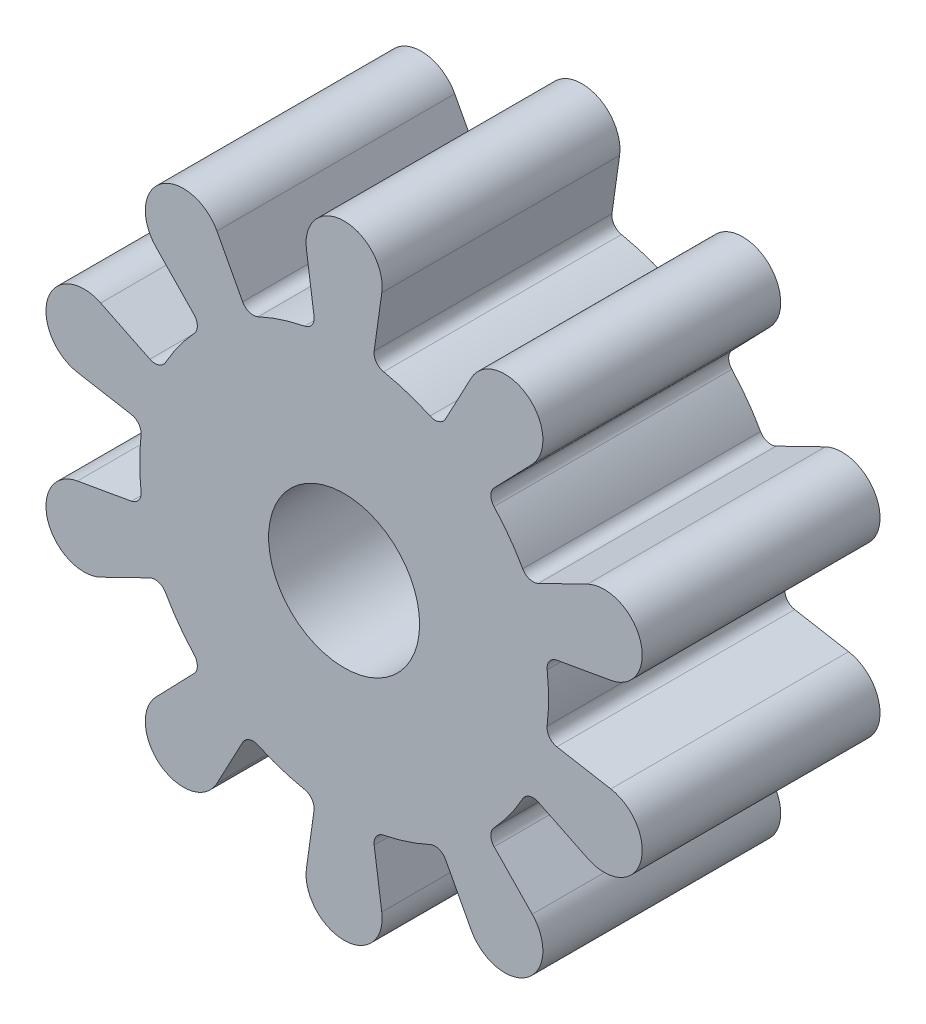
ISO-10303-21;
HEADER;
FILE_DESCRIPTION(('STEP AP214'),'2;1');
FILE_NAME('part.step','',(''),(''),'','','');
FILE_SCHEMA(('AUTOMOTIVE_DESIGN { 1 0 10303 214 1 1 1 1 }'));
ENDSEC;
DATA;
#1=APPLICATION_CONTEXT('core data for automotive mechanical design processes');
#2=APPLICATION_PROTOCOL_DEFINITION('international standard','automotive_design',2000,#1);
#3=PRODUCT_CONTEXT('',#1,'mechanical');
#4=PRODUCT('Part','Part','',(#3));
#5=PRODUCT_RELATED_PRODUCT_CATEGORY('part','',(#4));
#6=PRODUCT_DEFINITION_FORMATION('','',#4);
#7=PRODUCT_DEFINITION_CONTEXT('part definition',#1,'design');
#8=PRODUCT_DEFINITION('design','',#6,#7);
#9=PRODUCT_DEFINITION_SHAPE('','',#8);
#10=(LENGTH_UNIT() NAMED_UNIT(*) SI_UNIT(.MILLI.,.METRE.));
#11=(NAMED_UNIT(*) PLANE_ANGLE_UNIT() SI_UNIT($,.RADIAN.));
#12=(NAMED_UNIT(*) SI_UNIT($,.STERADIAN.) SOLID_ANGLE_UNIT());
#13=UNCERTAINTY_MEASURE_WITH_UNIT(LENGTH_MEASURE(1.E-05),#10,'distance_accuracy_value','');
#14=(GEOMETRIC_REPRESENTATION_CONTEXT(3) GLOBAL_UNCERTAINTY_ASSIGNED_CONTEXT((#13)) GLOBAL_UNIT_ASSIGNED_CONTEXT((#10,
#11,#12)) REPRESENTATION_CONTEXT('',''));
#15=CARTESIAN_POINT('',(0.,0.,0.));
#16=DIRECTION('',(0.,0.,1.));
#17=DIRECTION('',(1.,0.,0.));
#18=AXIS2_PLACEMENT_3D('',#15,#16,#17);
#19=CARTESIAN_POINT('',(7.94767581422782,-4.43220590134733,10.));
#20=DIRECTION('',(0.,0.,1.));
#21=DIRECTION('',(1.,0.,0.));
#22=AXIS2_PLACEMENT_3D('',#19,#20,#21);
#23=PLANE('',#22);
#24=CARTESIAN_POINT('',(7.94767581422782,-4.43220590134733,10.));
#25=DIRECTION('',(0.,0.,-1.));
#26=DIRECTION('',(1.,0.,0.));
#27=AXIS2_PLACEMENT_3D('',#24,#25,#26);
#28=CIRCLE('',#27,0.500000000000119);
#29=CARTESIAN_POINT('',(7.5109903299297,-4.18867810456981,10.));
#30=VERTEX_POINT('',#29);
#31=CARTESIAN_POINT('',(8.16684202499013,-3.98279943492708,10.));
#32=VERTEX_POINT('',#31);
#33=EDGE_CURVE('E559',#30,#32,#28,.T.);
#34=ORIENTED_EDGE('',*,*,#33,.T.);
#35=DIRECTION('',(0.898812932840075,-0.438332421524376,0.));
#36=VECTOR('',#35,1.);
#37=CARTESIAN_POINT('',(10.2358180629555,-4.99179612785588,10.));
#38=LINE('',#37,#36);
#39=CARTESIAN_POINT('',(10.2358180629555,-4.99179612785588,10.));
#40=VERTEX_POINT('',#39);
#41=EDGE_CURVE('E247',#32,#40,#38,.T.);
#42=ORIENTED_EDGE('',*,*,#41,.T.);
#43=CARTESIAN_POINT('',(10.9371499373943,-3.55369543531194,10.));
#44=DIRECTION('',(0.,0.,1.));
#45=DIRECTION('',(1.,0.,0.));
#46=AXIS2_PLACEMENT_3D('',#43,#44,#45);
#47=CIRCLE('',#46,1.59999999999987);
#48=CARTESIAN_POINT('',(11.2150549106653,-1.97801500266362,10.));
#49=VERTEX_POINT('',#48);
#50=EDGE_CURVE('E730',#40,#49,#47,.T.);
#51=ORIENTED_EDGE('',*,*,#50,.T.);
#52=DIRECTION('',(-0.984800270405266,0.173690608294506,0.));
#53=VECTOR('',#52,1.);
#54=CARTESIAN_POINT('',(11.2150549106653,-1.97801500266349,10.));
#55=LINE('',#54,#53);
#56=CARTESIAN_POINT('',(8.94814475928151,-1.57819687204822,10.));
#57=VERTEX_POINT('',#56);
#58=EDGE_CURVE('E749',#49,#57,#55,.T.);
#59=ORIENTED_EDGE('',*,*,#58,.T.);
#60=CARTESIAN_POINT('',(9.03499006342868,-1.0857967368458,10.));
#61=DIRECTION('',(0.,0.,-1.));
#62=DIRECTION('',(-1.,0.,0.));
#63=AXIS2_PLACEMENT_3D('',#60,#61,#62);
#64=CIRCLE('',#63,0.499999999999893);
#65=CARTESIAN_POINT('',(8.5385620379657,-1.02613757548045,10.));
#66=VERTEX_POINT('',#65);
#67=EDGE_CURVE('E746',#57,#66,#64,.T.);
#68=ORIENTED_EDGE('',*,*,#67,.T.);
#69=CARTESIAN_POINT('',(0.,0.,10.));
#70=DIRECTION('',(0.,0.,1.));
#71=DIRECTION('',(1.,0.,0.));
#72=AXIS2_PLACEMENT_3D('',#69,#70,#71);
#73=CIRCLE('',#72,8.6);
#74=CARTESIAN_POINT('',(8.53856203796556,1.02613757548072,10.));
#75=VERTEX_POINT('',#74);
#76=EDGE_CURVE('E748',#66,#75,#73,.T.);
#77=ORIENTED_EDGE('',*,*,#76,.T.);
#78=CARTESIAN_POINT('',(9.03499006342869,1.08579673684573,10.));
#79=DIRECTION('',(0.,0.,-1.));
#80=DIRECTION('',(1.,0.,0.));
#81=AXIS2_PLACEMENT_3D('',#78,#79,#80);
#82=CIRCLE('',#81,0.500000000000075);
#83=CARTESIAN_POINT('',(8.94814475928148,1.57819687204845,10.));
#84=VERTEX_POINT('',#83);
#85=EDGE_CURVE('E751',#75,#84,#82,.T.);
#86=ORIENTED_EDGE('',*,*,#85,.T.);
#87=DIRECTION('',(0.984800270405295,0.173690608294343,0.));
#88=VECTOR('',#87,1.);
#89=CARTESIAN_POINT('',(11.2150549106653,1.97801500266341,10.));
#90=LINE('',#89,#88);
#91=CARTESIAN_POINT('',(11.2150549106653,1.97801500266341,10.));
#92=VERTEX_POINT('',#91);
#93=EDGE_CURVE('E757',#84,#92,#90,.T.);
#94=ORIENTED_EDGE('',*,*,#93,.T.);
#95=CARTESIAN_POINT('',(10.9371499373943,3.55369543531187,10.));
#96=DIRECTION('',(0.,0.,1.));
#97=DIRECTION('',(1.,0.,0.));
#98=AXIS2_PLACEMENT_3D('',#95,#96,#97);
#99=CIRCLE('',#98,1.6);
#100=CARTESIAN_POINT('',(10.2358180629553,4.991796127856,10.));
#101=VERTEX_POINT('',#100);
#102=EDGE_CURVE('E759',#92,#101,#99,.T.);
#103=ORIENTED_EDGE('',*,*,#102,.T.);
#104=DIRECTION('',(-0.898812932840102,-0.43833242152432,0.));
#105=VECTOR('',#104,1.);
#106=CARTESIAN_POINT('',(10.2358180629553,4.991796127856,10.));
#107=LINE('',#106,#105);
#108=CARTESIAN_POINT('',(8.16684202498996,3.98279943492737,10.));
#109=VERTEX_POINT('',#108);
#110=EDGE_CURVE('E761',#101,#109,#107,.T.);
#111=ORIENTED_EDGE('',*,*,#110,.T.);
#112=CARTESIAN_POINT('',(7.94767581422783,4.43220590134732,10.));
#113=DIRECTION('',(0.,0.,-1.));
#114=DIRECTION('',(-1.,0.,0.));
#115=AXIS2_PLACEMENT_3D('',#112,#113,#114);
#116=CIRCLE('',#115,0.499999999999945);
#117=CARTESIAN_POINT('',(7.5109903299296,4.18867810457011,10.));
#118=VERTEX_POINT('',#117);
#119=EDGE_CURVE('E763',#109,#118,#116,.T.);
#120=ORIENTED_EDGE('',*,*,#119,.T.);
#121=CARTESIAN_POINT('',(0.,0.,10.));
#122=DIRECTION('',(0.,0.,1.));
#123=DIRECTION('',(1.,0.,0.));
#124=AXIS2_PLACEMENT_3D('',#121,#122,#123);
#125=CIRCLE('',#124,8.6);
#126=CARTESIAN_POINT('',(6.30469326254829,5.84900357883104,10.));
#127=VERTEX_POINT('',#126);
#128=EDGE_CURVE('E765',#118,#127,#125,.T.);
#129=ORIENTED_EDGE('',*,*,#128,.T.);
#130=CARTESIAN_POINT('',(6.67124519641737,6.18906192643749,10.));
#131=DIRECTION('',(0.,0.,-1.));
#132=DIRECTION('',(1.,0.,0.));
#133=AXIS2_PLACEMENT_3D('',#130,#131,#132);
#134=CIRCLE('',#133,0.499999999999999);
#135=CARTESIAN_POINT('',(6.31156033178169,6.53637561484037,10.));
#136=VERTEX_POINT('',#135);
#137=EDGE_CURVE('E767',#127,#136,#134,.T.);
#138=ORIENTED_EDGE('',*,*,#137,.T.);
#139=DIRECTION('',(0.694627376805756,0.719369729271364,0.));
#140=VECTOR('',#139,1.);
#141=CARTESIAN_POINT('',(7.91052196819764,8.19229163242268,10.));
#142=LINE('',#141,#140);
#143=CARTESIAN_POINT('',(7.91052196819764,8.19229163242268,10.));
#144=VERTEX_POINT('',#143);
#145=EDGE_CURVE('E769',#136,#144,#142,.T.);
#146=ORIENTED_EDGE('',*,*,#145,.T.);
#147=CARTESIAN_POINT('',(6.75953040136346,9.30369543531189,10.));
#148=DIRECTION('',(0.,0.,1.));
#149=DIRECTION('',(1.,0.,0.));
#150=AXIS2_PLACEMENT_3D('',#147,#148,#149);
#151=CIRCLE('',#150,1.6);
#152=CARTESIAN_POINT('',(5.34684661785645,10.0549108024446,10.));
#153=VERTEX_POINT('',#152);
#154=EDGE_CURVE('E771',#144,#153,#151,.T.);
#155=ORIENTED_EDGE('',*,*,#154,.T.);
#156=DIRECTION('',(-0.469509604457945,-0.882927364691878,0.));
#157=VECTOR('',#156,1.);
#158=CARTESIAN_POINT('',(5.34684661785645,10.0549108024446,10.));
#159=LINE('',#158,#157);
#160=CARTESIAN_POINT('',(4.26608321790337,8.02250172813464,10.));
#161=VERTEX_POINT('',#160);
#162=EDGE_CURVE('E773',#153,#161,#159,.T.);
#163=ORIENTED_EDGE('',*,*,#162,.T.);
#164=CARTESIAN_POINT('',(3.82461953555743,8.25725653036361,10.));
#165=DIRECTION('',(0.,0.,-1.));
#166=DIRECTION('',(-1.,0.,0.));
#167=AXIS2_PLACEMENT_3D('',#164,#165,#166);
#168=CIRCLE('',#167,0.499999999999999);
#169=CARTESIAN_POINT('',(3.6144756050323,7.80356111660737,10.));
#170=VERTEX_POINT('',#169);
#171=EDGE_CURVE('E775',#161,#170,#168,.T.);
#172=ORIENTED_EDGE('',*,*,#171,.T.);
#173=CARTESIAN_POINT('',(0.,0.,10.));
#174=DIRECTION('',(0.,0.,1.));
#175=DIRECTION('',(1.,0.,0.));
#176=AXIS2_PLACEMENT_3D('',#173,#174,#175);
#177=CIRCLE('',#176,8.6);
#178=CARTESIAN_POINT('',(1.66264594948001,8.4377490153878,10.));
#179=VERTEX_POINT('',#178);
#180=EDGE_CURVE('E777',#170,#179,#177,.T.);
#181=ORIENTED_EDGE('',*,*,#180,.T.);
#182=CARTESIAN_POINT('',(1.75931141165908,8.92831581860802,10.));
#183=DIRECTION('',(0.,0.,-1.));
#184=DIRECTION('',(1.,0.,0.));
#185=AXIS2_PLACEMENT_3D('',#182,#183,#184);
#186=CIRCLE('',#185,0.499999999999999);
#187=CARTESIAN_POINT('',(1.26417437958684,8.99788103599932,10.));
#188=VERTEX_POINT('',#187);
#189=EDGE_CURVE('E779',#179,#188,#186,.T.);
#190=ORIENTED_EDGE('',*,*,#189,.T.);
#191=DIRECTION('',(0.139130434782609,0.990274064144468,0.));
#192=VECTOR('',#191,1.);
#193=CARTESIAN_POINT('',(1.58443850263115,11.2773913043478,10.));
#194=LINE('',#193,#192);
#195=CARTESIAN_POINT('',(1.58443850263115,11.2773913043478,10.));
#196=VERTEX_POINT('',#195);
#197=EDGE_CURVE('E781',#188,#196,#194,.T.);
#198=ORIENTED_EDGE('',*,*,#197,.T.);
#199=CARTESIAN_POINT('',(0.,11.5,10.));
#200=DIRECTION('',(0.,0.,1.));
#201=DIRECTION('',(1.,0.,0.));
#202=AXIS2_PLACEMENT_3D('',#199,#200,#201);
#203=CIRCLE('',#202,1.6);
#204=CARTESIAN_POINT('',(-1.58443850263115,11.2773913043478,10.));
#205=VERTEX_POINT('',#204);
#206=EDGE_CURVE('E783',#196,#205,#203,.T.);
#207=ORIENTED_EDGE('',*,*,#206,.T.);
#208=DIRECTION('',(0.139130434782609,-0.990274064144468,0.));
#209=VECTOR('',#208,1.);
#210=CARTESIAN_POINT('',(-1.58443850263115,11.2773913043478,10.));
#211=LINE('',#210,#209);
#212=CARTESIAN_POINT('',(-1.26417437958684,8.99788103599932,10.));
#213=VERTEX_POINT('',#212);
#214=EDGE_CURVE('E785',#205,#213,#211,.T.);
#215=ORIENTED_EDGE('',*,*,#214,.T.);
#216=CARTESIAN_POINT('',(-1.75931141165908,8.92831581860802,10.));
#217=DIRECTION('',(0.,0.,-1.));
#218=DIRECTION('',(-1.,0.,0.));
#219=AXIS2_PLACEMENT_3D('',#216,#217,#218);
#220=CIRCLE('',#219,0.499999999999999);
#221=CARTESIAN_POINT('',(-1.66264594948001,8.4377490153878,10.));
#222=VERTEX_POINT('',#221);
#223=EDGE_CURVE('E787',#213,#222,#220,.T.);
#224=ORIENTED_EDGE('',*,*,#223,.T.);
#225=CARTESIAN_POINT('',(0.,0.,10.));
#226=DIRECTION('',(0.,0.,1.));
#227=DIRECTION('',(1.,0.,0.));
#228=AXIS2_PLACEMENT_3D('',#225,#226,#227);
#229=CIRCLE('',#228,8.6);
#230=CARTESIAN_POINT('',(-3.61447560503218,7.80356111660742,10.));
#231=VERTEX_POINT('',#230);
#232=EDGE_CURVE('E789',#222,#231,#229,.T.);
#233=ORIENTED_EDGE('',*,*,#232,.T.);
#234=CARTESIAN_POINT('',(-3.82461953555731,8.25725653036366,10.));
#235=DIRECTION('',(0.,0.,-1.));
#236=DIRECTION('',(1.,0.,0.));
#237=AXIS2_PLACEMENT_3D('',#234,#235,#236);
#238=CIRCLE('',#237,0.5);
#239=CARTESIAN_POINT('',(-4.26608321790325,8.0225017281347,10.));
#240=VERTEX_POINT('',#239);
#241=EDGE_CURVE('E791',#231,#240,#238,.T.);
#242=ORIENTED_EDGE('',*,*,#241,.T.);
#243=DIRECTION('',(-0.469509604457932,0.882927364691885,0.));
#244=VECTOR('',#243,1.);
#245=CARTESIAN_POINT('',(-5.3468466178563,10.0549108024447,10.));
#246=LINE('',#245,#244);
#247=CARTESIAN_POINT('',(-5.3468466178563,10.0549108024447,10.));
#248=VERTEX_POINT('',#247);
#249=EDGE_CURVE('E793',#240,#248,#246,.T.);
#250=ORIENTED_EDGE('',*,*,#249,.T.);
#251=CARTESIAN_POINT('',(-6.75953040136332,9.30369543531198,10.));
#252=DIRECTION('',(0.,0.,1.));
#253=DIRECTION('',(1.,0.,0.));
#254=AXIS2_PLACEMENT_3D('',#251,#252,#253);
#255=CIRCLE('',#254,1.6);
#256=CARTESIAN_POINT('',(-7.91052196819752,8.19229163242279,10.));
#257=VERTEX_POINT('',#256);
#258=EDGE_CURVE('E795',#248,#257,#255,.T.);
#259=ORIENTED_EDGE('',*,*,#258,.T.);
#260=DIRECTION('',(0.694627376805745,-0.719369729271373,0.));
#261=VECTOR('',#260,1.);
#262=CARTESIAN_POINT('',(-7.91052196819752,8.19229163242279,10.));
#263=LINE('',#262,#261);
#264=CARTESIAN_POINT('',(-6.3115603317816,6.53637561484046,10.));
#265=VERTEX_POINT('',#264);
#266=EDGE_CURVE('E797',#257,#265,#263,.T.);
#267=ORIENTED_EDGE('',*,*,#266,.T.);
#268=CARTESIAN_POINT('',(-6.67124519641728,6.18906192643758,10.));
#269=DIRECTION('',(0.,0.,-1.));
#270=DIRECTION('',(-1.,0.,0.));
#271=AXIS2_PLACEMENT_3D('',#268,#269,#270);
#272=CIRCLE('',#271,0.5);
#273=CARTESIAN_POINT('',(-6.3046932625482,5.84900357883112,10.));
#274=VERTEX_POINT('',#273);
#275=EDGE_CURVE('E799',#265,#274,#272,.T.);
#276=ORIENTED_EDGE('',*,*,#275,.T.);
#277=CARTESIAN_POINT('',(0.,0.,10.));
#278=DIRECTION('',(0.,0.,1.));
#279=DIRECTION('',(1.,0.,0.));
#280=AXIS2_PLACEMENT_3D('',#277,#278,#279);
#281=CIRCLE('',#280,8.6);
#282=CARTESIAN_POINT('',(-7.51099032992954,4.1886781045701,10.));
#283=VERTEX_POINT('',#282);
#284=EDGE_CURVE('E801',#274,#283,#281,.T.);
#285=ORIENTED_EDGE('',*,*,#284,.T.);
#286=CARTESIAN_POINT('',(-7.94767581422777,4.43220590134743,10.));
#287=DIRECTION('',(0.,0.,-1.));
#288=DIRECTION('',(1.,0.,0.));
#289=AXIS2_PLACEMENT_3D('',#286,#287,#288);
#290=CIRCLE('',#289,0.500000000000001);
#291=CARTESIAN_POINT('',(-8.16684202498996,3.98279943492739,10.));
#292=VERTEX_POINT('',#291);
#293=EDGE_CURVE('E803',#283,#292,#290,.T.);
#294=ORIENTED_EDGE('',*,*,#293,.T.);
#295=DIRECTION('',(-0.898812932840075,0.438332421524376,0.));
#296=VECTOR('',#295,1.);
#297=CARTESIAN_POINT('',(-10.2358180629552,4.99179612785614,10.));
#298=LINE('',#297,#296);
#299=CARTESIAN_POINT('',(-10.2358180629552,4.99179612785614,10.));
#300=VERTEX_POINT('',#299);
#301=EDGE_CURVE('E805',#292,#300,#298,.T.);
#302=ORIENTED_EDGE('',*,*,#301,.T.);
#303=CARTESIAN_POINT('',(-10.9371499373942,3.55369543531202,10.));
#304=DIRECTION('',(0.,0.,1.));
#305=DIRECTION('',(1.,0.,0.));
#306=AXIS2_PLACEMENT_3D('',#303,#304,#305);
#307=CIRCLE('',#306,1.6);
#308=CARTESIAN_POINT('',(-11.2150549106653,1.97801500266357,10.));
#309=VERTEX_POINT('',#308);
#310=EDGE_CURVE('E807',#300,#309,#307,.T.);
#311=ORIENTED_EDGE('',*,*,#310,.T.);
#312=DIRECTION('',(0.984800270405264,-0.173690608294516,0.));
#313=VECTOR('',#312,1.);
#314=CARTESIAN_POINT('',(-11.2150549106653,1.97801500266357,10.));
#315=LINE('',#314,#313);
#316=CARTESIAN_POINT('',(-8.9481447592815,1.57819687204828,10.));
#317=VERTEX_POINT('',#316);
#318=EDGE_CURVE('E809',#309,#317,#315,.T.);
#319=ORIENTED_EDGE('',*,*,#318,.T.);
#320=CARTESIAN_POINT('',(-9.03499006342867,1.08579673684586,10.));
#321=DIRECTION('',(0.,0.,-1.));
#322=DIRECTION('',(-1.,0.,0.));
#323=AXIS2_PLACEMENT_3D('',#320,#321,#322);
#324=CIRCLE('',#323,0.499999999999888);
#325=CARTESIAN_POINT('',(-8.5385620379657,1.02613757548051,10.));
#326=VERTEX_POINT('',#325);
#327=EDGE_CURVE('E811',#317,#326,#324,.T.);
#328=ORIENTED_EDGE('',*,*,#327,.T.);
#329=CARTESIAN_POINT('',(0.,0.,10.));
#330=DIRECTION('',(0.,0.,1.));
#331=DIRECTION('',(1.,0.,0.));
#332=AXIS2_PLACEMENT_3D('',#329,#330,#331);
#333=CIRCLE('',#332,8.59999999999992);
#334=CARTESIAN_POINT('',(-8.53856203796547,-1.02613757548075,10.));
#335=VERTEX_POINT('',#334);
#336=EDGE_CURVE('E813',#326,#335,#333,.T.);
#337=ORIENTED_EDGE('',*,*,#336,.T.);
#338=CARTESIAN_POINT('',(-9.0349900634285,-1.0857967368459,10.));
#339=DIRECTION('',(0.,0.,-1.));
#340=DIRECTION('',(1.,0.,0.));
#341=AXIS2_PLACEMENT_3D('',#338,#339,#340);
#342=CIRCLE('',#341,0.5);
#343=CARTESIAN_POINT('',(-8.94814475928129,-1.57819687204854,10.));
#344=VERTEX_POINT('',#343);
#345=EDGE_CURVE('E815',#335,#344,#342,.T.);
#346=ORIENTED_EDGE('',*,*,#345,.T.);
#347=DIRECTION('',(-0.984800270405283,-0.17369060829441,0.));
#348=VECTOR('',#347,1.);
#349=CARTESIAN_POINT('',(-11.2150549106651,-1.97801500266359,10.));
#350=LINE('',#349,#348);
#351=CARTESIAN_POINT('',(-11.2150549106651,-1.97801500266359,10.));
#352=VERTEX_POINT('',#351);
#353=EDGE_CURVE('E817',#344,#352,#350,.T.);
#354=ORIENTED_EDGE('',*,*,#353,.T.);
#355=CARTESIAN_POINT('',(-10.9371499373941,-3.55369543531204,10.));
#356=DIRECTION('',(0.,0.,1.));
#357=DIRECTION('',(1.,0.,0.));
#358=AXIS2_PLACEMENT_3D('',#355,#356,#357);
#359=CIRCLE('',#358,1.6);
#360=CARTESIAN_POINT('',(-10.2358180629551,-4.99179612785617,10.));
#361=VERTEX_POINT('',#360);
#362=EDGE_CURVE('E819',#352,#361,#359,.T.);
#363=ORIENTED_EDGE('',*,*,#362,.T.);
#364=DIRECTION('',(0.89881293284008,0.438332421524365,0.));
#365=VECTOR('',#364,1.);
#366=CARTESIAN_POINT('',(-10.2358180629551,-4.99179612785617,10.));
#367=LINE('',#366,#365);
#368=CARTESIAN_POINT('',(-8.1668420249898,-3.98279943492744,10.));
#369=VERTEX_POINT('',#368);
#370=EDGE_CURVE('E821',#361,#369,#367,.T.);
#371=ORIENTED_EDGE('',*,*,#370,.T.);
#372=CARTESIAN_POINT('',(-7.94767581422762,-4.43220590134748,10.));
#373=DIRECTION('',(0.,0.,-1.));
#374=DIRECTION('',(-1.,0.,0.));
#375=AXIS2_PLACEMENT_3D('',#372,#373,#374);
#376=CIRCLE('',#375,0.500000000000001);
#377=CARTESIAN_POINT('',(-7.51099032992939,-4.18867810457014,10.));
#378=VERTEX_POINT('',#377);
#379=EDGE_CURVE('E823',#369,#378,#376,.T.);
#380=ORIENTED_EDGE('',*,*,#379,.T.);
#381=CARTESIAN_POINT('',(0.,0.,10.));
#382=DIRECTION('',(0.,0.,1.));
#383=DIRECTION('',(1.,0.,0.));
#384=AXIS2_PLACEMENT_3D('',#381,#382,#383);
#385=CIRCLE('',#384,8.59999999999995);
#386=CARTESIAN_POINT('',(-6.30469326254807,-5.84900357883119,10.));
#387=VERTEX_POINT('',#386);
#388=EDGE_CURVE('E825',#378,#387,#385,.T.);
#389=ORIENTED_EDGE('',*,*,#388,.T.);
#390=CARTESIAN_POINT('',(-6.67124519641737,-6.1890619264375,10.));
#391=DIRECTION('',(0.,0.,-1.));
#392=DIRECTION('',(1.,0.,0.));
#393=AXIS2_PLACEMENT_3D('',#390,#391,#392);
#394=CIRCLE('',#393,0.500000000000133);
#395=CARTESIAN_POINT('',(-6.3115603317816,-6.53637561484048,10.));
#396=VERTEX_POINT('',#395);
#397=EDGE_CURVE('E827',#387,#396,#394,.T.);
#398=ORIENTED_EDGE('',*,*,#397,.T.);
#399=DIRECTION('',(-0.694627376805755,-0.719369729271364,0.));
#400=VECTOR('',#399,1.);
#401=CARTESIAN_POINT('',(-7.91052196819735,-8.19229163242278,10.));
#402=LINE('',#401,#400);
#403=CARTESIAN_POINT('',(-7.91052196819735,-8.19229163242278,10.));
#404=VERTEX_POINT('',#403);
#405=EDGE_CURVE('E829',#396,#404,#402,.T.);
#406=ORIENTED_EDGE('',*,*,#405,.T.);
#407=CARTESIAN_POINT('',(-6.75953040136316,-9.30369543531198,10.));
#408=DIRECTION('',(0.,0.,1.));
#409=DIRECTION('',(1.,0.,0.));
#410=AXIS2_PLACEMENT_3D('',#407,#408,#409);
#411=CIRCLE('',#410,1.6);
#412=CARTESIAN_POINT('',(-5.34684661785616,-10.0549108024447,10.));
#413=VERTEX_POINT('',#412);
#414=EDGE_CURVE('E831',#404,#413,#411,.T.);
#415=ORIENTED_EDGE('',*,*,#414,.T.);
#416=DIRECTION('',(0.469509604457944,0.882927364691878,0.));
#417=VECTOR('',#416,1.);
#418=CARTESIAN_POINT('',(-5.34684661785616,-10.0549108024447,10.));
#419=LINE('',#418,#417);
#420=CARTESIAN_POINT('',(-4.26608321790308,-8.02250172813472,10.));
#421=VERTEX_POINT('',#420);
#422=EDGE_CURVE('E833',#413,#421,#419,.T.);
#423=ORIENTED_EDGE('',*,*,#422,.T.);
#424=CARTESIAN_POINT('',(-3.82461953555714,-8.25725653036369,10.));
#425=DIRECTION('',(0.,0.,-1.));
#426=DIRECTION('',(-1.,0.,0.));
#427=AXIS2_PLACEMENT_3D('',#424,#425,#426);
#428=CIRCLE('',#427,0.500000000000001);
#429=CARTESIAN_POINT('',(-3.61447560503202,-7.80356111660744,10.));
#430=VERTEX_POINT('',#429);
#431=EDGE_CURVE('E835',#421,#430,#428,.T.);
#432=ORIENTED_EDGE('',*,*,#431,.T.);
#433=CARTESIAN_POINT('',(0.,0.,10.));
#434=DIRECTION('',(0.,0.,1.));
#435=DIRECTION('',(1.,0.,0.));
#436=AXIS2_PLACEMENT_3D('',#433,#434,#435);
#437=CIRCLE('',#436,8.59999999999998);
#438=CARTESIAN_POINT('',(-1.66264594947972,-8.43774901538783,10.));
#439=VERTEX_POINT('',#438);
#440=EDGE_CURVE('E837',#430,#439,#437,.T.);
#441=ORIENTED_EDGE('',*,*,#440,.T.);
#442=CARTESIAN_POINT('',(-1.75931141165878,-8.92831581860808,10.));
#443=DIRECTION('',(0.,0.,-1.));
#444=DIRECTION('',(1.,0.,0.));
#445=AXIS2_PLACEMENT_3D('',#442,#443,#444);
#446=CIRCLE('',#445,0.499999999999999);
#447=CARTESIAN_POINT('',(-1.26417437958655,-8.99788103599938,10.));
#448=VERTEX_POINT('',#447);
#449=EDGE_CURVE('E839',#439,#448,#446,.T.);
#450=ORIENTED_EDGE('',*,*,#449,.T.);
#451=DIRECTION('',(-0.139130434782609,-0.990274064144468,0.));
#452=VECTOR('',#451,1.);
#453=CARTESIAN_POINT('',(-1.58443850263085,-11.2773913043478,10.));
#454=LINE('',#453,#452);
#455=CARTESIAN_POINT('',(-1.58443850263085,-11.2773913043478,10.));
#456=VERTEX_POINT('',#455);
#457=EDGE_CURVE('E841',#448,#456,#454,.T.);
#458=ORIENTED_EDGE('',*,*,#457,.T.);
#459=CARTESIAN_POINT('',(3.03040877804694E-13,-11.5,10.));
#460=DIRECTION('',(0.,0.,1.));
#461=DIRECTION('',(1.,0.,0.));
#462=AXIS2_PLACEMENT_3D('',#459,#460,#461);
#463=CIRCLE('',#462,1.6);
#464=CARTESIAN_POINT('',(1.58443850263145,-11.2773913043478,10.));
#465=VERTEX_POINT('',#464);
#466=EDGE_CURVE('E843',#456,#465,#463,.T.);
#467=ORIENTED_EDGE('',*,*,#466,.T.);
#468=DIRECTION('',(-0.139130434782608,0.990274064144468,0.));
#469=VECTOR('',#468,1.);
#470=CARTESIAN_POINT('',(1.58443850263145,-11.2773913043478,10.));
#471=LINE('',#470,#469);
#472=CARTESIAN_POINT('',(1.26417437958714,-8.99788103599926,10.));
#473=VERTEX_POINT('',#472);
#474=EDGE_CURVE('E845',#465,#473,#471,.T.);
#475=ORIENTED_EDGE('',*,*,#474,.T.);
#476=CARTESIAN_POINT('',(1.75931141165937,-8.92831581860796,10.));
#477=DIRECTION('',(0.,0.,-1.));
#478=DIRECTION('',(-1.,0.,0.));
#479=AXIS2_PLACEMENT_3D('',#476,#477,#478);
#480=CIRCLE('',#479,0.499999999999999);
#481=CARTESIAN_POINT('',(1.66264594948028,-8.43774901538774,10.));
#482=VERTEX_POINT('',#481);
#483=EDGE_CURVE('E847',#473,#482,#480,.T.);
#484=ORIENTED_EDGE('',*,*,#483,.T.);
#485=CARTESIAN_POINT('',(0.,0.,10.));
#486=DIRECTION('',(0.,0.,1.));
#487=DIRECTION('',(1.,0.,0.));
#488=AXIS2_PLACEMENT_3D('',#485,#486,#487);
#489=CIRCLE('',#488,8.6);
#490=CARTESIAN_POINT('',(3.61447560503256,-7.80356111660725,10.));
#491=VERTEX_POINT('',#490);
#492=EDGE_CURVE('E849',#482,#491,#489,.T.);
#493=ORIENTED_EDGE('',*,*,#492,.T.);
#494=CARTESIAN_POINT('',(3.82461953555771,-8.25725653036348,10.));
#495=DIRECTION('',(0.,0.,-1.));
#496=DIRECTION('',(1.,0.,0.));
#497=AXIS2_PLACEMENT_3D('',#494,#495,#496);
#498=CIRCLE('',#497,0.5);
#499=CARTESIAN_POINT('',(4.26608321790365,-8.02250172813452,10.));
#500=VERTEX_POINT('',#499);
#501=EDGE_CURVE('E851',#491,#500,#498,.T.);
#502=ORIENTED_EDGE('',*,*,#501,.T.);
#503=DIRECTION('',(0.469509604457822,-0.882927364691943,0.));
#504=VECTOR('',#503,1.);
#505=CARTESIAN_POINT('',(5.34684661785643,-10.0549108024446,10.));
#506=LINE('',#505,#504);
#507=CARTESIAN_POINT('',(5.34684661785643,-10.0549108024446,10.));
#508=VERTEX_POINT('',#507);
#509=EDGE_CURVE('E853',#500,#508,#506,.T.);
#510=ORIENTED_EDGE('',*,*,#509,.T.);
#511=CARTESIAN_POINT('',(6.75953040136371,-9.30369543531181,10.));
#512=DIRECTION('',(0.,0.,1.));
#513=DIRECTION('',(1.,0.,0.));
#514=AXIS2_PLACEMENT_3D('',#511,#512,#513);
#515=CIRCLE('',#514,1.60000000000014);
#516=CARTESIAN_POINT('',(7.910521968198,-8.1922916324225,10.));
#517=VERTEX_POINT('',#516);
#518=EDGE_CURVE('E422',#508,#517,#515,.T.);
#519=ORIENTED_EDGE('',*,*,#518,.T.);
#520=DIRECTION('',(-0.694627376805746,0.719369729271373,0.));
#521=VECTOR('',#520,1.);
#522=CARTESIAN_POINT('',(7.9105219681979,-8.1922916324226,10.));
#523=LINE('',#522,#521);
#524=CARTESIAN_POINT('',(6.31156033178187,-6.53637561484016,10.));
#525=VERTEX_POINT('',#524);
#526=EDGE_CURVE('E416',#517,#525,#523,.T.);
#527=ORIENTED_EDGE('',*,*,#526,.T.);
#528=CARTESIAN_POINT('',(6.67124519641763,-6.1890619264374,10.));
#529=DIRECTION('',(0.,0.,-1.));
#530=DIRECTION('',(-1.,0.,0.));
#531=AXIS2_PLACEMENT_3D('',#528,#529,#530);
#532=CIRCLE('',#531,0.500000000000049);
#533=CARTESIAN_POINT('',(6.30469326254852,-5.8490035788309,10.));
#534=VERTEX_POINT('',#533);
#535=EDGE_CURVE('E420',#525,#534,#532,.T.);
#536=ORIENTED_EDGE('',*,*,#535,.T.);
#537=CARTESIAN_POINT('',(0.,0.,10.));
#538=DIRECTION('',(0.,0.,1.));
#539=DIRECTION('',(1.,0.,0.));
#540=AXIS2_PLACEMENT_3D('',#537,#538,#539);
#541=CIRCLE('',#540,8.6);
#542=EDGE_CURVE('E48',#534,#30,#541,.T.);
#543=ORIENTED_EDGE('',*,*,#542,.T.);
#544=EDGE_LOOP('',(#34,#42,#51,#59,#68,#77,#86,#94,#103,#111,#120,#129,#138,#146,#155,#163,#172,
#181,#190,#198,#207,#215,#224,#233,#242,#250,#259,#267,#276,#285,#294,#302,#311,#319,#328,#337,
#346,#354,#363,#371,#380,#389,#398,#406,#415,#423,#432,#441,#450,#458,#467,#475,#484,#493,#502,
#510,#519,#527,#536,#543));
#545=FACE_BOUND('',#544,.T.);
#546=CARTESIAN_POINT('',(0.,0.,10.));
#547=DIRECTION('',(0.,0.,1.));
#548=DIRECTION('',(1.,0.,0.));
#549=AXIS2_PLACEMENT_3D('',#546,#547,#548);
#550=CIRCLE('',#549,3.175);
#551=CARTESIAN_POINT('',(3.175,0.,10.));
#552=VERTEX_POINT('',#551);
#553=EDGE_CURVE('E444',#552,#552,#550,.T.);
#554=ORIENTED_EDGE('',*,*,#553,.F.);
#555=EDGE_LOOP('',(#554));
#556=FACE_BOUND('',#555,.T.);
#557=ADVANCED_FACE('F31',(#545,#556),#23,.T.);
#558=CARTESIAN_POINT('',(7.94767581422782,-4.43220590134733,0.));
#559=DIRECTION('',(0.,0.,1.));
#560=DIRECTION('',(1.,0.,0.));
#561=AXIS2_PLACEMENT_3D('',#558,#559,#560);
#562=PLANE('',#561);
#563=CARTESIAN_POINT('',(7.94767581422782,-4.43220590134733,0.));
#564=DIRECTION('',(0.,0.,-1.));
#565=DIRECTION('',(1.,0.,0.));
#566=AXIS2_PLACEMENT_3D('',#563,#564,#565);
#567=CIRCLE('',#566,0.500000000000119);
#568=CARTESIAN_POINT('',(7.5109903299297,-4.18867810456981,0.));
#569=VERTEX_POINT('',#568);
#570=CARTESIAN_POINT('',(8.16684202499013,-3.98279943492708,0.));
#571=VERTEX_POINT('',#570);
#572=EDGE_CURVE('E440',#569,#571,#567,.T.);
#573=ORIENTED_EDGE('',*,*,#572,.F.);
#574=CARTESIAN_POINT('',(0.,0.,0.));
#575=DIRECTION('',(0.,0.,1.));
#576=DIRECTION('',(1.,0.,0.));
#577=AXIS2_PLACEMENT_3D('',#574,#575,#576);
#578=CIRCLE('',#577,8.6);
#579=CARTESIAN_POINT('',(6.30469326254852,-5.8490035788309,0.));
#580=VERTEX_POINT('',#579);
#581=EDGE_CURVE('E239',#580,#569,#578,.T.);
#582=ORIENTED_EDGE('',*,*,#581,.F.);
#583=CARTESIAN_POINT('',(6.67124519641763,-6.1890619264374,0.));
#584=DIRECTION('',(0.,0.,-1.));
#585=DIRECTION('',(-1.,0.,0.));
#586=AXIS2_PLACEMENT_3D('',#583,#584,#585);
#587=CIRCLE('',#586,0.500000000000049);
#588=CARTESIAN_POINT('',(6.31156033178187,-6.53637561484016,0.));
#589=VERTEX_POINT('',#588);
#590=EDGE_CURVE('E233',#589,#580,#587,.T.);
#591=ORIENTED_EDGE('',*,*,#590,.F.);
#592=DIRECTION('',(-0.694627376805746,0.719369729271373,0.));
#593=VECTOR('',#592,1.);
#594=CARTESIAN_POINT('',(7.9105219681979,-8.1922916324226,0.));
#595=LINE('',#594,#593);
#596=CARTESIAN_POINT('',(7.910521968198,-8.1922916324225,0.));
#597=VERTEX_POINT('',#596);
#598=EDGE_CURVE('E430',#597,#589,#595,.T.);
#599=ORIENTED_EDGE('',*,*,#598,.F.);
#600=CARTESIAN_POINT('',(6.75953040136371,-9.30369543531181,0.));
#601=DIRECTION('',(0.,0.,1.));
#602=DIRECTION('',(1.,0.,0.));
#603=AXIS2_PLACEMENT_3D('',#600,#601,#602);
#604=CIRCLE('',#603,1.60000000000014);
#605=CARTESIAN_POINT('',(5.34684661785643,-10.0549108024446,0.));
#606=VERTEX_POINT('',#605);
#607=EDGE_CURVE('E554',#606,#597,#604,.T.);
#608=ORIENTED_EDGE('',*,*,#607,.F.);
#609=DIRECTION('',(0.469509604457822,-0.882927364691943,0.));
#610=VECTOR('',#609,1.);
#611=CARTESIAN_POINT('',(5.34684661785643,-10.0549108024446,0.));
#612=LINE('',#611,#610);
#613=CARTESIAN_POINT('',(4.26608321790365,-8.02250172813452,0.));
#614=VERTEX_POINT('',#613);
#615=EDGE_CURVE('E552',#614,#606,#612,.T.);
#616=ORIENTED_EDGE('',*,*,#615,.F.);
#617=CARTESIAN_POINT('',(3.82461953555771,-8.25725653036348,0.));
#618=DIRECTION('',(0.,0.,-1.));
#619=DIRECTION('',(1.,0.,0.));
#620=AXIS2_PLACEMENT_3D('',#617,#618,#619);
#621=CIRCLE('',#620,0.5);
#622=CARTESIAN_POINT('',(3.61447560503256,-7.80356111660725,0.));
#623=VERTEX_POINT('',#622);
#624=EDGE_CURVE('E550',#623,#614,#621,.T.);
#625=ORIENTED_EDGE('',*,*,#624,.F.);
#626=CARTESIAN_POINT('',(0.,0.,0.));
#627=DIRECTION('',(0.,0.,1.));
#628=DIRECTION('',(1.,0.,0.));
#629=AXIS2_PLACEMENT_3D('',#626,#627,#628);
#630=CIRCLE('',#629,8.6);
#631=CARTESIAN_POINT('',(1.66264594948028,-8.43774901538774,0.));
#632=VERTEX_POINT('',#631);
#633=EDGE_CURVE('E548',#632,#623,#630,.T.);
#634=ORIENTED_EDGE('',*,*,#633,.F.);
#635=CARTESIAN_POINT('',(1.75931141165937,-8.92831581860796,0.));
#636=DIRECTION('',(0.,0.,-1.));
#637=DIRECTION('',(-1.,0.,0.));
#638=AXIS2_PLACEMENT_3D('',#635,#636,#637);
#639=CIRCLE('',#638,0.499999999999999);
#640=CARTESIAN_POINT('',(1.26417437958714,-8.99788103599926,0.));
#641=VERTEX_POINT('',#640);
#642=EDGE_CURVE('E546',#641,#632,#639,.T.);
#643=ORIENTED_EDGE('',*,*,#642,.F.);
#644=DIRECTION('',(-0.139130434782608,0.990274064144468,0.));
#645=VECTOR('',#644,1.);
#646=CARTESIAN_POINT('',(1.58443850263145,-11.2773913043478,0.));
#647=LINE('',#646,#645);
#648=CARTESIAN_POINT('',(1.58443850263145,-11.2773913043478,0.));
#649=VERTEX_POINT('',#648);
#650=EDGE_CURVE('E544',#649,#641,#647,.T.);
#651=ORIENTED_EDGE('',*,*,#650,.F.);
#652=CARTESIAN_POINT('',(3.03040877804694E-13,-11.5,0.));
#653=DIRECTION('',(0.,0.,1.));
#654=DIRECTION('',(1.,0.,0.));
#655=AXIS2_PLACEMENT_3D('',#652,#653,#654);
#656=CIRCLE('',#655,1.6);
#657=CARTESIAN_POINT('',(-1.58443850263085,-11.2773913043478,0.));
#658=VERTEX_POINT('',#657);
#659=EDGE_CURVE('E542',#658,#649,#656,.T.);
#660=ORIENTED_EDGE('',*,*,#659,.F.);
#661=DIRECTION('',(-0.139130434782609,-0.990274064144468,0.));
#662=VECTOR('',#661,1.);
#663=CARTESIAN_POINT('',(-1.58443850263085,-11.2773913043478,0.));
#664=LINE('',#663,#662);
#665=CARTESIAN_POINT('',(-1.26417437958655,-8.99788103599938,0.));
#666=VERTEX_POINT('',#665);
#667=EDGE_CURVE('E540',#666,#658,#664,.T.);
#668=ORIENTED_EDGE('',*,*,#667,.F.);
#669=CARTESIAN_POINT('',(-1.75931141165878,-8.92831581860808,0.));
#670=DIRECTION('',(0.,0.,-1.));
#671=DIRECTION('',(1.,0.,0.));
#672=AXIS2_PLACEMENT_3D('',#669,#670,#671);
#673=CIRCLE('',#672,0.499999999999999);
#674=CARTESIAN_POINT('',(-1.66264594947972,-8.43774901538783,0.));
#675=VERTEX_POINT('',#674);
#676=EDGE_CURVE('E538',#675,#666,#673,.T.);
#677=ORIENTED_EDGE('',*,*,#676,.F.);
#678=CARTESIAN_POINT('',(0.,0.,0.));
#679=DIRECTION('',(0.,0.,1.));
#680=DIRECTION('',(1.,0.,0.));
#681=AXIS2_PLACEMENT_3D('',#678,#679,#680);
#682=CIRCLE('',#681,8.59999999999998);
#683=CARTESIAN_POINT('',(-3.61447560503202,-7.80356111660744,0.));
#684=VERTEX_POINT('',#683);
#685=EDGE_CURVE('E536',#684,#675,#682,.T.);
#686=ORIENTED_EDGE('',*,*,#685,.F.);
#687=CARTESIAN_POINT('',(-3.82461953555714,-8.25725653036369,0.));
#688=DIRECTION('',(0.,0.,-1.));
#689=DIRECTION('',(-1.,0.,0.));
#690=AXIS2_PLACEMENT_3D('',#687,#688,#689);
#691=CIRCLE('',#690,0.500000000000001);
#692=CARTESIAN_POINT('',(-4.26608321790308,-8.02250172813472,0.));
#693=VERTEX_POINT('',#692);
#694=EDGE_CURVE('E534',#693,#684,#691,.T.);
#695=ORIENTED_EDGE('',*,*,#694,.F.);
#696=DIRECTION('',(0.469509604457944,0.882927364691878,0.));
#697=VECTOR('',#696,1.);
#698=CARTESIAN_POINT('',(-5.34684661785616,-10.0549108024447,0.));
#699=LINE('',#698,#697);
#700=CARTESIAN_POINT('',(-5.34684661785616,-10.0549108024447,0.));
#701=VERTEX_POINT('',#700);
#702=EDGE_CURVE('E532',#701,#693,#699,.T.);
#703=ORIENTED_EDGE('',*,*,#702,.F.);
#704=CARTESIAN_POINT('',(-6.75953040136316,-9.30369543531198,0.));
#705=DIRECTION('',(0.,0.,1.));
#706=DIRECTION('',(1.,0.,0.));
#707=AXIS2_PLACEMENT_3D('',#704,#705,#706);
#708=CIRCLE('',#707,1.6);
#709=CARTESIAN_POINT('',(-7.91052196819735,-8.19229163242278,0.));
#710=VERTEX_POINT('',#709);
#711=EDGE_CURVE('E530',#710,#701,#708,.T.);
#712=ORIENTED_EDGE('',*,*,#711,.F.);
#713=DIRECTION('',(-0.694627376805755,-0.719369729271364,0.));
#714=VECTOR('',#713,1.);
#715=CARTESIAN_POINT('',(-7.91052196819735,-8.19229163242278,0.));
#716=LINE('',#715,#714);
#717=CARTESIAN_POINT('',(-6.3115603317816,-6.53637561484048,0.));
#718=VERTEX_POINT('',#717);
#719=EDGE_CURVE('E528',#718,#710,#716,.T.);
#720=ORIENTED_EDGE('',*,*,#719,.F.);
#721=CARTESIAN_POINT('',(-6.67124519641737,-6.1890619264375,0.));
#722=DIRECTION('',(0.,0.,-1.));
#723=DIRECTION('',(1.,0.,0.));
#724=AXIS2_PLACEMENT_3D('',#721,#722,#723);
#725=CIRCLE('',#724,0.500000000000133);
#726=CARTESIAN_POINT('',(-6.30469326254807,-5.84900357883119,0.));
#727=VERTEX_POINT('',#726);
#728=EDGE_CURVE('E526',#727,#718,#725,.T.);
#729=ORIENTED_EDGE('',*,*,#728,.F.);
#730=CARTESIAN_POINT('',(0.,0.,0.));
#731=DIRECTION('',(0.,0.,1.));
#732=DIRECTION('',(1.,0.,0.));
#733=AXIS2_PLACEMENT_3D('',#730,#731,#732);
#734=CIRCLE('',#733,8.59999999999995);
#735=CARTESIAN_POINT('',(-7.51099032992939,-4.18867810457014,0.));
#736=VERTEX_POINT('',#735);
#737=EDGE_CURVE('E524',#736,#727,#734,.T.);
#738=ORIENTED_EDGE('',*,*,#737,.F.);
#739=CARTESIAN_POINT('',(-7.94767581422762,-4.43220590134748,0.));
#740=DIRECTION('',(0.,0.,-1.));
#741=DIRECTION('',(-1.,0.,0.));
#742=AXIS2_PLACEMENT_3D('',#739,#740,#741);
#743=CIRCLE('',#742,0.500000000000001);
#744=CARTESIAN_POINT('',(-8.1668420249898,-3.98279943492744,0.));
#745=VERTEX_POINT('',#744);
#746=EDGE_CURVE('E522',#745,#736,#743,.T.);
#747=ORIENTED_EDGE('',*,*,#746,.F.);
#748=DIRECTION('',(0.89881293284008,0.438332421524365,0.));
#749=VECTOR('',#748,1.);
#750=CARTESIAN_POINT('',(-10.2358180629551,-4.99179612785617,0.));
#751=LINE('',#750,#749);
#752=CARTESIAN_POINT('',(-10.2358180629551,-4.99179612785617,0.));
#753=VERTEX_POINT('',#752);
#754=EDGE_CURVE('E520',#753,#745,#751,.T.);
#755=ORIENTED_EDGE('',*,*,#754,.F.);
#756=CARTESIAN_POINT('',(-10.9371499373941,-3.55369543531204,0.));
#757=DIRECTION('',(0.,0.,1.));
#758=DIRECTION('',(1.,0.,0.));
#759=AXIS2_PLACEMENT_3D('',#756,#757,#758);
#760=CIRCLE('',#759,1.6);
#761=CARTESIAN_POINT('',(-11.2150549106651,-1.97801500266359,0.));
#762=VERTEX_POINT('',#761);
#763=EDGE_CURVE('E518',#762,#753,#760,.T.);
#764=ORIENTED_EDGE('',*,*,#763,.F.);
#765=DIRECTION('',(-0.984800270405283,-0.17369060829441,0.));
#766=VECTOR('',#765,1.);
#767=CARTESIAN_POINT('',(-11.2150549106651,-1.97801500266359,0.));
#768=LINE('',#767,#766);
#769=CARTESIAN_POINT('',(-8.94814475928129,-1.57819687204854,0.));
#770=VERTEX_POINT('',#769);
#771=EDGE_CURVE('E516',#770,#762,#768,.T.);
#772=ORIENTED_EDGE('',*,*,#771,.F.);
#773=CARTESIAN_POINT('',(-9.0349900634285,-1.0857967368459,0.));
#774=DIRECTION('',(0.,0.,-1.));
#775=DIRECTION('',(1.,0.,0.));
#776=AXIS2_PLACEMENT_3D('',#773,#774,#775);
#777=CIRCLE('',#776,0.5);
#778=CARTESIAN_POINT('',(-8.53856203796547,-1.02613757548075,0.));
#779=VERTEX_POINT('',#778);
#780=EDGE_CURVE('E514',#779,#770,#777,.T.);
#781=ORIENTED_EDGE('',*,*,#780,.F.);
#782=CARTESIAN_POINT('',(0.,0.,0.));
#783=DIRECTION('',(0.,0.,1.));
#784=DIRECTION('',(1.,0.,0.));
#785=AXIS2_PLACEMENT_3D('',#782,#783,#784);
#786=CIRCLE('',#785,8.59999999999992);
#787=CARTESIAN_POINT('',(-8.5385620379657,1.02613757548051,0.));
#788=VERTEX_POINT('',#787);
#789=EDGE_CURVE('E512',#788,#779,#786,.T.);
#790=ORIENTED_EDGE('',*,*,#789,.F.);
#791=CARTESIAN_POINT('',(-9.03499006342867,1.08579673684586,0.));
#792=DIRECTION('',(0.,0.,-1.));
#793=DIRECTION('',(-1.,0.,0.));
#794=AXIS2_PLACEMENT_3D('',#791,#792,#793);
#795=CIRCLE('',#794,0.499999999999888);
#796=CARTESIAN_POINT('',(-8.9481447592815,1.57819687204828,0.));
#797=VERTEX_POINT('',#796);
#798=EDGE_CURVE('E510',#797,#788,#795,.T.);
#799=ORIENTED_EDGE('',*,*,#798,.F.);
#800=DIRECTION('',(0.984800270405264,-0.173690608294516,0.));
#801=VECTOR('',#800,1.);
#802=CARTESIAN_POINT('',(-11.2150549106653,1.97801500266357,0.));
#803=LINE('',#802,#801);
#804=CARTESIAN_POINT('',(-11.2150549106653,1.97801500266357,0.));
#805=VERTEX_POINT('',#804);
#806=EDGE_CURVE('E508',#805,#797,#803,.T.);
#807=ORIENTED_EDGE('',*,*,#806,.F.);
#808=CARTESIAN_POINT('',(-10.9371499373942,3.55369543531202,0.));
#809=DIRECTION('',(0.,0.,1.));
#810=DIRECTION('',(1.,0.,0.));
#811=AXIS2_PLACEMENT_3D('',#808,#809,#810);
#812=CIRCLE('',#811,1.6);
#813=CARTESIAN_POINT('',(-10.2358180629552,4.99179612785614,0.));
#814=VERTEX_POINT('',#813);
#815=EDGE_CURVE('E506',#814,#805,#812,.T.);
#816=ORIENTED_EDGE('',*,*,#815,.F.);
#817=DIRECTION('',(-0.898812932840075,0.438332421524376,0.));
#818=VECTOR('',#817,1.);
#819=CARTESIAN_POINT('',(-10.2358180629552,4.99179612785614,0.));
#820=LINE('',#819,#818);
#821=CARTESIAN_POINT('',(-8.16684202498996,3.98279943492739,0.));
#822=VERTEX_POINT('',#821);
#823=EDGE_CURVE('E504',#822,#814,#820,.T.);
#824=ORIENTED_EDGE('',*,*,#823,.F.);
#825=CARTESIAN_POINT('',(-7.94767581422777,4.43220590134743,0.));
#826=DIRECTION('',(0.,0.,-1.));
#827=DIRECTION('',(1.,0.,0.));
#828=AXIS2_PLACEMENT_3D('',#825,#826,#827);
#829=CIRCLE('',#828,0.500000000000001);
#830=CARTESIAN_POINT('',(-7.51099032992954,4.1886781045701,0.));
#831=VERTEX_POINT('',#830);
#832=EDGE_CURVE('E502',#831,#822,#829,.T.);
#833=ORIENTED_EDGE('',*,*,#832,.F.);
#834=CARTESIAN_POINT('',(0.,0.,0.));
#835=DIRECTION('',(0.,0.,1.));
#836=DIRECTION('',(1.,0.,0.));
#837=AXIS2_PLACEMENT_3D('',#834,#835,#836);
#838=CIRCLE('',#837,8.6);
#839=CARTESIAN_POINT('',(-6.3046932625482,5.84900357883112,0.));
#840=VERTEX_POINT('',#839);
#841=EDGE_CURVE('E500',#840,#831,#838,.T.);
#842=ORIENTED_EDGE('',*,*,#841,.F.);
#843=CARTESIAN_POINT('',(-6.67124519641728,6.18906192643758,0.));
#844=DIRECTION('',(0.,0.,-1.));
#845=DIRECTION('',(-1.,0.,0.));
#846=AXIS2_PLACEMENT_3D('',#843,#844,#845);
#847=CIRCLE('',#846,0.5);
#848=CARTESIAN_POINT('',(-6.3115603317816,6.53637561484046,0.));
#849=VERTEX_POINT('',#848);
#850=EDGE_CURVE('E498',#849,#840,#847,.T.);
#851=ORIENTED_EDGE('',*,*,#850,.F.);
#852=DIRECTION('',(0.694627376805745,-0.719369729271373,0.));
#853=VECTOR('',#852,1.);
#854=CARTESIAN_POINT('',(-7.91052196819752,8.19229163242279,0.));
#855=LINE('',#854,#853);
#856=CARTESIAN_POINT('',(-7.91052196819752,8.19229163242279,0.));
#857=VERTEX_POINT('',#856);
#858=EDGE_CURVE('E496',#857,#849,#855,.T.);
#859=ORIENTED_EDGE('',*,*,#858,.F.);
#860=CARTESIAN_POINT('',(-6.75953040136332,9.30369543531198,0.));
#861=DIRECTION('',(0.,0.,1.));
#862=DIRECTION('',(1.,0.,0.));
#863=AXIS2_PLACEMENT_3D('',#860,#861,#862);
#864=CIRCLE('',#863,1.6);
#865=CARTESIAN_POINT('',(-5.3468466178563,10.0549108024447,0.));
#866=VERTEX_POINT('',#865);
#867=EDGE_CURVE('E494',#866,#857,#864,.T.);
#868=ORIENTED_EDGE('',*,*,#867,.F.);
#869=DIRECTION('',(-0.469509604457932,0.882927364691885,0.));
#870=VECTOR('',#869,1.);
#871=CARTESIAN_POINT('',(-5.3468466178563,10.0549108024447,0.));
#872=LINE('',#871,#870);
#873=CARTESIAN_POINT('',(-4.26608321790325,8.0225017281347,0.));
#874=VERTEX_POINT('',#873);
#875=EDGE_CURVE('E492',#874,#866,#872,.T.);
#876=ORIENTED_EDGE('',*,*,#875,.F.);
#877=CARTESIAN_POINT('',(-3.82461953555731,8.25725653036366,0.));
#878=DIRECTION('',(0.,0.,-1.));
#879=DIRECTION('',(1.,0.,0.));
#880=AXIS2_PLACEMENT_3D('',#877,#878,#879);
#881=CIRCLE('',#880,0.5);
#882=CARTESIAN_POINT('',(-3.61447560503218,7.80356111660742,0.));
#883=VERTEX_POINT('',#882);
#884=EDGE_CURVE('E490',#883,#874,#881,.T.);
#885=ORIENTED_EDGE('',*,*,#884,.F.);
#886=CARTESIAN_POINT('',(0.,0.,0.));
#887=DIRECTION('',(0.,0.,1.));
#888=DIRECTION('',(1.,0.,0.));
#889=AXIS2_PLACEMENT_3D('',#886,#887,#888);
#890=CIRCLE('',#889,8.6);
#891=CARTESIAN_POINT('',(-1.66264594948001,8.4377490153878,0.));
#892=VERTEX_POINT('',#891);
#893=EDGE_CURVE('E488',#892,#883,#890,.T.);
#894=ORIENTED_EDGE('',*,*,#893,.F.);
#895=CARTESIAN_POINT('',(-1.75931141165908,8.92831581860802,0.));
#896=DIRECTION('',(0.,0.,-1.));
#897=DIRECTION('',(-1.,0.,0.));
#898=AXIS2_PLACEMENT_3D('',#895,#896,#897);
#899=CIRCLE('',#898,0.499999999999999);
#900=CARTESIAN_POINT('',(-1.26417437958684,8.99788103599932,0.));
#901=VERTEX_POINT('',#900);
#902=EDGE_CURVE('E486',#901,#892,#899,.T.);
#903=ORIENTED_EDGE('',*,*,#902,.F.);
#904=DIRECTION('',(0.139130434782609,-0.990274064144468,0.));
#905=VECTOR('',#904,1.);
#906=CARTESIAN_POINT('',(-1.58443850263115,11.2773913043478,0.));
#907=LINE('',#906,#905);
#908=CARTESIAN_POINT('',(-1.58443850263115,11.2773913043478,0.));
#909=VERTEX_POINT('',#908);
#910=EDGE_CURVE('E484',#909,#901,#907,.T.);
#911=ORIENTED_EDGE('',*,*,#910,.F.);
#912=CARTESIAN_POINT('',(0.,11.5,0.));
#913=DIRECTION('',(0.,0.,1.));
#914=DIRECTION('',(1.,0.,0.));
#915=AXIS2_PLACEMENT_3D('',#912,#913,#914);
#916=CIRCLE('',#915,1.6);
#917=CARTESIAN_POINT('',(1.58443850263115,11.2773913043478,0.));
#918=VERTEX_POINT('',#917);
#919=EDGE_CURVE('E482',#918,#909,#916,.T.);
#920=ORIENTED_EDGE('',*,*,#919,.F.);
#921=DIRECTION('',(0.139130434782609,0.990274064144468,0.));
#922=VECTOR('',#921,1.);
#923=CARTESIAN_POINT('',(1.58443850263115,11.2773913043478,0.));
#924=LINE('',#923,#922);
#925=CARTESIAN_POINT('',(1.26417437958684,8.99788103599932,0.));
#926=VERTEX_POINT('',#925);
#927=EDGE_CURVE('E480',#926,#918,#924,.T.);
#928=ORIENTED_EDGE('',*,*,#927,.F.);
#929=CARTESIAN_POINT('',(1.75931141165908,8.92831581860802,0.));
#930=DIRECTION('',(0.,0.,-1.));
#931=DIRECTION('',(1.,0.,0.));
#932=AXIS2_PLACEMENT_3D('',#929,#930,#931);
#933=CIRCLE('',#932,0.499999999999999);
#934=CARTESIAN_POINT('',(1.66264594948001,8.4377490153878,0.));
#935=VERTEX_POINT('',#934);
#936=EDGE_CURVE('E478',#935,#926,#933,.T.);
#937=ORIENTED_EDGE('',*,*,#936,.F.);
#938=CARTESIAN_POINT('',(0.,0.,0.));
#939=DIRECTION('',(0.,0.,1.));
#940=DIRECTION('',(1.,0.,0.));
#941=AXIS2_PLACEMENT_3D('',#938,#939,#940);
#942=CIRCLE('',#941,8.6);
#943=CARTESIAN_POINT('',(3.6144756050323,7.80356111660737,0.));
#944=VERTEX_POINT('',#943);
#945=EDGE_CURVE('E476',#944,#935,#942,.T.);
#946=ORIENTED_EDGE('',*,*,#945,.F.);
#947=CARTESIAN_POINT('',(3.82461953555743,8.25725653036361,0.));
#948=DIRECTION('',(0.,0.,-1.));
#949=DIRECTION('',(-1.,0.,0.));
#950=AXIS2_PLACEMENT_3D('',#947,#948,#949);
#951=CIRCLE('',#950,0.499999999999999);
#952=CARTESIAN_POINT('',(4.26608321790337,8.02250172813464,0.));
#953=VERTEX_POINT('',#952);
#954=EDGE_CURVE('E474',#953,#944,#951,.T.);
#955=ORIENTED_EDGE('',*,*,#954,.F.);
#956=DIRECTION('',(-0.469509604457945,-0.882927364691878,0.));
#957=VECTOR('',#956,1.);
#958=CARTESIAN_POINT('',(5.34684661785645,10.0549108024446,0.));
#959=LINE('',#958,#957);
#960=CARTESIAN_POINT('',(5.34684661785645,10.0549108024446,0.));
#961=VERTEX_POINT('',#960);
#962=EDGE_CURVE('E472',#961,#953,#959,.T.);
#963=ORIENTED_EDGE('',*,*,#962,.F.);
#964=CARTESIAN_POINT('',(6.75953040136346,9.30369543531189,0.));
#965=DIRECTION('',(0.,0.,1.));
#966=DIRECTION('',(1.,0.,0.));
#967=AXIS2_PLACEMENT_3D('',#964,#965,#966);
#968=CIRCLE('',#967,1.6);
#969=CARTESIAN_POINT('',(7.91052196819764,8.19229163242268,0.));
#970=VERTEX_POINT('',#969);
#971=EDGE_CURVE('E470',#970,#961,#968,.T.);
#972=ORIENTED_EDGE('',*,*,#971,.F.);
#973=DIRECTION('',(0.694627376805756,0.719369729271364,0.));
#974=VECTOR('',#973,1.);
#975=CARTESIAN_POINT('',(7.91052196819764,8.19229163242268,0.));
#976=LINE('',#975,#974);
#977=CARTESIAN_POINT('',(6.31156033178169,6.53637561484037,0.));
#978=VERTEX_POINT('',#977);
#979=EDGE_CURVE('E468',#978,#970,#976,.T.);
#980=ORIENTED_EDGE('',*,*,#979,.F.);
#981=CARTESIAN_POINT('',(6.67124519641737,6.18906192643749,0.));
#982=DIRECTION('',(0.,0.,-1.));
#983=DIRECTION('',(1.,0.,0.));
#984=AXIS2_PLACEMENT_3D('',#981,#982,#983);
#985=CIRCLE('',#984,0.499999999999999);
#986=CARTESIAN_POINT('',(6.30469326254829,5.84900357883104,0.));
#987=VERTEX_POINT('',#986);
#988=EDGE_CURVE('E466',#987,#978,#985,.T.);
#989=ORIENTED_EDGE('',*,*,#988,.F.);
#990=CARTESIAN_POINT('',(0.,0.,0.));
#991=DIRECTION('',(0.,0.,1.));
#992=DIRECTION('',(1.,0.,0.));
#993=AXIS2_PLACEMENT_3D('',#990,#991,#992);
#994=CIRCLE('',#993,8.6);
#995=CARTESIAN_POINT('',(7.5109903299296,4.18867810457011,0.));
#996=VERTEX_POINT('',#995);
#997=EDGE_CURVE('E464',#996,#987,#994,.T.);
#998=ORIENTED_EDGE('',*,*,#997,.F.);
#999=CARTESIAN_POINT('',(7.94767581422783,4.43220590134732,0.));
#1000=DIRECTION('',(0.,0.,-1.));
#1001=DIRECTION('',(-1.,0.,0.));
#1002=AXIS2_PLACEMENT_3D('',#999,#1000,#1001);
#1003=CIRCLE('',#1002,0.499999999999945);
#1004=CARTESIAN_POINT('',(8.16684202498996,3.98279943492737,0.));
#1005=VERTEX_POINT('',#1004);
#1006=EDGE_CURVE('E462',#1005,#996,#1003,.T.);
#1007=ORIENTED_EDGE('',*,*,#1006,.F.);
#1008=DIRECTION('',(-0.898812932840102,-0.43833242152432,0.));
#1009=VECTOR('',#1008,1.);
#1010=CARTESIAN_POINT('',(10.2358180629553,4.991796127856,0.));
#1011=LINE('',#1010,#1009);
#1012=CARTESIAN_POINT('',(10.2358180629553,4.991796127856,0.));
#1013=VERTEX_POINT('',#1012);
#1014=EDGE_CURVE('E460',#1013,#1005,#1011,.T.);
#1015=ORIENTED_EDGE('',*,*,#1014,.F.);
#1016=CARTESIAN_POINT('',(10.9371499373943,3.55369543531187,0.));
#1017=DIRECTION('',(0.,0.,1.));
#1018=DIRECTION('',(1.,0.,0.));
#1019=AXIS2_PLACEMENT_3D('',#1016,#1017,#1018);
#1020=CIRCLE('',#1019,1.6);
#1021=CARTESIAN_POINT('',(11.2150549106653,1.97801500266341,0.));
#1022=VERTEX_POINT('',#1021);
#1023=EDGE_CURVE('E458',#1022,#1013,#1020,.T.);
#1024=ORIENTED_EDGE('',*,*,#1023,.F.);
#1025=DIRECTION('',(0.984800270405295,0.173690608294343,0.));
#1026=VECTOR('',#1025,1.);
#1027=CARTESIAN_POINT('',(11.2150549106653,1.97801500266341,0.));
#1028=LINE('',#1027,#1026);
#1029=CARTESIAN_POINT('',(8.94814475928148,1.57819687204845,0.));
#1030=VERTEX_POINT('',#1029);
#1031=EDGE_CURVE('E456',#1030,#1022,#1028,.T.);
#1032=ORIENTED_EDGE('',*,*,#1031,.F.);
#1033=CARTESIAN_POINT('',(9.03499006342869,1.08579673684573,0.));
#1034=DIRECTION('',(0.,0.,-1.));
#1035=DIRECTION('',(1.,0.,0.));
#1036=AXIS2_PLACEMENT_3D('',#1033,#1034,#1035);
#1037=CIRCLE('',#1036,0.500000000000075);
#1038=CARTESIAN_POINT('',(8.53856203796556,1.02613757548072,0.));
#1039=VERTEX_POINT('',#1038);
#1040=EDGE_CURVE('E454',#1039,#1030,#1037,.T.);
#1041=ORIENTED_EDGE('',*,*,#1040,.F.);
#1042=CARTESIAN_POINT('',(0.,0.,0.));
#1043=DIRECTION('',(0.,0.,1.));
#1044=DIRECTION('',(1.,0.,0.));
#1045=AXIS2_PLACEMENT_3D('',#1042,#1043,#1044);
#1046=CIRCLE('',#1045,8.6);
#1047=CARTESIAN_POINT('',(8.5385620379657,-1.02613757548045,0.));
#1048=VERTEX_POINT('',#1047);
#1049=EDGE_CURVE('E452',#1048,#1039,#1046,.T.);
#1050=ORIENTED_EDGE('',*,*,#1049,.F.);
#1051=CARTESIAN_POINT('',(9.03499006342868,-1.0857967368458,0.));
#1052=DIRECTION('',(0.,0.,-1.));
#1053=DIRECTION('',(-1.,0.,0.));
#1054=AXIS2_PLACEMENT_3D('',#1051,#1052,#1053);
#1055=CIRCLE('',#1054,0.499999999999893);
#1056=CARTESIAN_POINT('',(8.94814475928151,-1.57819687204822,0.));
#1057=VERTEX_POINT('',#1056);
#1058=EDGE_CURVE('E450',#1057,#1048,#1055,.T.);
#1059=ORIENTED_EDGE('',*,*,#1058,.F.);
#1060=DIRECTION('',(-0.984800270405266,0.173690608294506,0.));
#1061=VECTOR('',#1060,1.);
#1062=CARTESIAN_POINT('',(11.2150549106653,-1.97801500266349,0.));
#1063=LINE('',#1062,#1061);
#1064=CARTESIAN_POINT('',(11.2150549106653,-1.97801500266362,0.));
#1065=VERTEX_POINT('',#1064);
#1066=EDGE_CURVE('E448',#1065,#1057,#1063,.T.);
#1067=ORIENTED_EDGE('',*,*,#1066,.F.);
#1068=CARTESIAN_POINT('',(10.9371499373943,-3.55369543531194,0.));
#1069=DIRECTION('',(0.,0.,1.));
#1070=DIRECTION('',(1.,0.,0.));
#1071=AXIS2_PLACEMENT_3D('',#1068,#1069,#1070);
#1072=CIRCLE('',#1071,1.59999999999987);
#1073=CARTESIAN_POINT('',(10.2358180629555,-4.99179612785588,0.));
#1074=VERTEX_POINT('',#1073);
#1075=EDGE_CURVE('E446',#1074,#1065,#1072,.T.);
#1076=ORIENTED_EDGE('',*,*,#1075,.F.);
#1077=DIRECTION('',(0.898812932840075,-0.438332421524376,0.));
#1078=VECTOR('',#1077,1.);
#1079=CARTESIAN_POINT('',(10.2358180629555,-4.99179612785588,0.));
#1080=LINE('',#1079,#1078);
#1081=EDGE_CURVE('E443',#571,#1074,#1080,.T.);
#1082=ORIENTED_EDGE('',*,*,#1081,.F.);
#1083=EDGE_LOOP('',(#573,#582,#591,#599,#608,#616,#625,#634,#643,#651,#660,#668,#677,#686,#695,
#703,#712,#720,#729,#738,#747,#755,#764,#772,#781,#790,#799,#807,#816,#824,#833,#842,#851,#859,
#868,#876,#885,#894,#903,#911,#920,#928,#937,#946,#955,#963,#972,#980,#989,#998,#1007,#1015,
#1024,#1032,#1041,#1050,#1059,#1067,#1076,#1082));
#1084=FACE_BOUND('',#1083,.T.);
#1085=CARTESIAN_POINT('',(0.,0.,0.));
#1086=DIRECTION('',(0.,0.,1.));
#1087=DIRECTION('',(1.,0.,0.));
#1088=AXIS2_PLACEMENT_3D('',#1085,#1086,#1087);
#1089=CIRCLE('',#1088,3.175);
#1090=CARTESIAN_POINT('',(3.175,0.,0.));
#1091=VERTEX_POINT('',#1090);
#1092=EDGE_CURVE('E1624',#1091,#1091,#1089,.T.);
#1093=ORIENTED_EDGE('',*,*,#1092,.T.);
#1094=EDGE_LOOP('',(#1093));
#1095=FACE_BOUND('',#1094,.T.);
#1096=ADVANCED_FACE('F734',(#1084,#1095),#562,.F.);
#1097=CARTESIAN_POINT('',(7.94767581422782,-4.43220590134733,10.));
#1098=DIRECTION('',(0.,0.,-1.));
#1099=DIRECTION('',(-1.,0.,0.));
#1100=AXIS2_PLACEMENT_3D('',#1097,#1098,#1099);
#1101=CYLINDRICAL_SURFACE('',#1100,0.500000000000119);
#1102=ORIENTED_EDGE('',*,*,#572,.T.);
#1103=DIRECTION('',(0.,0.,-1.));
#1104=VECTOR('',#1103,1.);
#1105=CARTESIAN_POINT('',(8.16684202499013,-3.98279943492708,10.));
#1106=LINE('',#1105,#1104);
#1107=EDGE_CURVE('E11',#32,#571,#1106,.T.);
#1108=ORIENTED_EDGE('',*,*,#1107,.F.);
#1109=ORIENTED_EDGE('',*,*,#33,.F.);
#1110=DIRECTION('',(0.,0.,-1.));
#1111=VECTOR('',#1110,1.);
#1112=CARTESIAN_POINT('',(7.5109903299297,-4.18867810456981,10.));
#1113=LINE('',#1112,#1111);
#1114=EDGE_CURVE('E436',#30,#569,#1113,.T.);
#1115=ORIENTED_EDGE('',*,*,#1114,.T.);
#1116=EDGE_LOOP('',(#1102,#1108,#1109,#1115));
#1117=FACE_BOUND('',#1116,.T.);
#1118=ADVANCED_FACE('F33',(#1117),#1101,.F.);
#1119=CARTESIAN_POINT('',(10.2358180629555,-4.99179612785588,10.));
#1120=DIRECTION('',(0.438332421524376,0.898812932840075,0.));
#1121=DIRECTION('',(-0.898812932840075,0.438332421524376,0.));
#1122=AXIS2_PLACEMENT_3D('',#1119,#1120,#1121);
#1123=PLANE('',#1122);
#1124=ORIENTED_EDGE('',*,*,#1081,.T.);
#1125=DIRECTION('',(0.,0.,-1.));
#1126=VECTOR('',#1125,1.);
#1127=CARTESIAN_POINT('',(10.2358180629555,-4.99179612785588,10.));
#1128=LINE('',#1127,#1126);
#1129=EDGE_CURVE('E40',#40,#1074,#1128,.T.);
#1130=ORIENTED_EDGE('',*,*,#1129,.F.);
#1131=ORIENTED_EDGE('',*,*,#41,.F.);
#1132=ORIENTED_EDGE('',*,*,#1107,.T.);
#1133=EDGE_LOOP('',(#1124,#1130,#1131,#1132));
#1134=FACE_BOUND('',#1133,.T.);
#1135=ADVANCED_FACE('F887',(#1134),#1123,.F.);
#1136=CARTESIAN_POINT('',(10.9371499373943,-3.55369543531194,10.));
#1137=DIRECTION('',(0.,0.,-1.));
#1138=DIRECTION('',(-1.,0.,0.));
#1139=AXIS2_PLACEMENT_3D('',#1136,#1137,#1138);
#1140=CYLINDRICAL_SURFACE('',#1139,1.59999999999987);
#1141=ORIENTED_EDGE('',*,*,#1075,.T.);
#1142=DIRECTION('',(0.,0.,-1.));
#1143=VECTOR('',#1142,1.);
#1144=CARTESIAN_POINT('',(11.2150549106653,-1.97801500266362,10.));
#1145=LINE('',#1144,#1143);
#1146=EDGE_CURVE('E722',#49,#1065,#1145,.T.);
#1147=ORIENTED_EDGE('',*,*,#1146,.F.);
#1148=ORIENTED_EDGE('',*,*,#50,.F.);
#1149=ORIENTED_EDGE('',*,*,#1129,.T.);
#1150=EDGE_LOOP('',(#1141,#1147,#1148,#1149));
#1151=FACE_BOUND('',#1150,.T.);
#1152=ADVANCED_FACE('F728',(#1151),#1140,.T.);
#1153=CARTESIAN_POINT('',(11.2150549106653,-1.97801500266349,10.));
#1154=DIRECTION('',(-0.173690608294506,-0.984800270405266,0.));
#1155=DIRECTION('',(0.984800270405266,-0.173690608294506,0.));
#1156=AXIS2_PLACEMENT_3D('',#1153,#1154,#1155);
#1157=PLANE('',#1156);
#1158=ORIENTED_EDGE('',*,*,#1066,.T.);
#1159=DIRECTION('',(0.,0.,-1.));
#1160=VECTOR('',#1159,1.);
#1161=CARTESIAN_POINT('',(8.94814475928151,-1.57819687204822,10.));
#1162=LINE('',#1161,#1160);
#1163=EDGE_CURVE('E719',#57,#1057,#1162,.T.);
#1164=ORIENTED_EDGE('',*,*,#1163,.F.);
#1165=ORIENTED_EDGE('',*,*,#58,.F.);
#1166=ORIENTED_EDGE('',*,*,#1146,.T.);
#1167=EDGE_LOOP('',(#1158,#1164,#1165,#1166));
#1168=FACE_BOUND('',#1167,.T.);
#1169=ADVANCED_FACE('F740',(#1168),#1157,.F.);
#1170=CARTESIAN_POINT('',(9.03499006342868,-1.0857967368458,10.));
#1171=DIRECTION('',(0.,0.,-1.));
#1172=DIRECTION('',(-1.,0.,0.));
#1173=AXIS2_PLACEMENT_3D('',#1170,#1171,#1172);
#1174=CYLINDRICAL_SURFACE('',#1173,0.499999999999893);
#1175=ORIENTED_EDGE('',*,*,#1058,.T.);
#1176=DIRECTION('',(0.,0.,-1.));
#1177=VECTOR('',#1176,1.);
#1178=CARTESIAN_POINT('',(8.5385620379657,-1.02613757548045,10.));
#1179=LINE('',#1178,#1177);
#1180=EDGE_CURVE('E716',#66,#1048,#1179,.T.);
#1181=ORIENTED_EDGE('',*,*,#1180,.F.);
#1182=ORIENTED_EDGE('',*,*,#67,.F.);
#1183=ORIENTED_EDGE('',*,*,#1163,.T.);
#1184=EDGE_LOOP('',(#1175,#1181,#1182,#1183));
#1185=FACE_BOUND('',#1184,.T.);
#1186=ADVANCED_FACE('F744',(#1185),#1174,.F.);
#1187=CARTESIAN_POINT('',(0.,0.,10.));
#1188=DIRECTION('',(0.,0.,-1.));
#1189=DIRECTION('',(-1.,0.,0.));
#1190=AXIS2_PLACEMENT_3D('',#1187,#1188,#1189);
#1191=CYLINDRICAL_SURFACE('',#1190,8.6);
#1192=ORIENTED_EDGE('',*,*,#1049,.T.);
#1193=DIRECTION('',(0.,0.,-1.));
#1194=VECTOR('',#1193,1.);
#1195=CARTESIAN_POINT('',(8.53856203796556,1.02613757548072,10.));
#1196=LINE('',#1195,#1194);
#1197=EDGE_CURVE('E713',#75,#1039,#1196,.T.);
#1198=ORIENTED_EDGE('',*,*,#1197,.F.);
#1199=ORIENTED_EDGE('',*,*,#76,.F.);
#1200=ORIENTED_EDGE('',*,*,#1180,.T.);
#1201=EDGE_LOOP('',(#1192,#1198,#1199,#1200));
#1202=FACE_BOUND('',#1201,.T.);
#1203=ADVANCED_FACE('F900',(#1202),#1191,.T.);
#1204=CARTESIAN_POINT('',(9.03499006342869,1.08579673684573,10.));
#1205=DIRECTION('',(0.,0.,-1.));
#1206=DIRECTION('',(-1.,0.,0.));
#1207=AXIS2_PLACEMENT_3D('',#1204,#1205,#1206);
#1208=CYLINDRICAL_SURFACE('',#1207,0.500000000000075);
#1209=ORIENTED_EDGE('',*,*,#1040,.T.);
#1210=DIRECTION('',(0.,0.,-1.));
#1211=VECTOR('',#1210,1.);
#1212=CARTESIAN_POINT('',(8.94814475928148,1.57819687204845,10.));
#1213=LINE('',#1212,#1211);
#1214=EDGE_CURVE('E710',#84,#1030,#1213,.T.);
#1215=ORIENTED_EDGE('',*,*,#1214,.F.);
#1216=ORIENTED_EDGE('',*,*,#85,.F.);
#1217=ORIENTED_EDGE('',*,*,#1197,.T.);
#1218=EDGE_LOOP('',(#1209,#1215,#1216,#1217));
#1219=FACE_BOUND('',#1218,.T.);
#1220=ADVANCED_FACE('F903',(#1219),#1208,.F.);
#1221=CARTESIAN_POINT('',(11.2150549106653,1.97801500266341,10.));
#1222=DIRECTION('',(-0.173690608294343,0.984800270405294,0.));
#1223=DIRECTION('',(-0.984800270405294,-0.173690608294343,0.));
#1224=AXIS2_PLACEMENT_3D('',#1221,#1222,#1223);
#1225=PLANE('',#1224);
#1226=ORIENTED_EDGE('',*,*,#1031,.T.);
#1227=DIRECTION('',(0.,0.,-1.));
#1228=VECTOR('',#1227,1.);
#1229=CARTESIAN_POINT('',(11.2150549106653,1.97801500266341,10.));
#1230=LINE('',#1229,#1228);
#1231=EDGE_CURVE('E707',#92,#1022,#1230,.T.);
#1232=ORIENTED_EDGE('',*,*,#1231,.F.);
#1233=ORIENTED_EDGE('',*,*,#93,.F.);
#1234=ORIENTED_EDGE('',*,*,#1214,.T.);
#1235=EDGE_LOOP('',(#1226,#1232,#1233,#1234));
#1236=FACE_BOUND('',#1235,.T.);
#1237=ADVANCED_FACE('F907',(#1236),#1225,.F.);
#1238=CARTESIAN_POINT('',(10.9371499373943,3.55369543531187,10.));
#1239=DIRECTION('',(0.,0.,-1.));
#1240=DIRECTION('',(-1.,0.,0.));
#1241=AXIS2_PLACEMENT_3D('',#1238,#1239,#1240);
#1242=CYLINDRICAL_SURFACE('',#1241,1.6);
#1243=ORIENTED_EDGE('',*,*,#1023,.T.);
#1244=DIRECTION('',(0.,0.,-1.));
#1245=VECTOR('',#1244,1.);
#1246=CARTESIAN_POINT('',(10.2358180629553,4.991796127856,10.));
#1247=LINE('',#1246,#1245);
#1248=EDGE_CURVE('E704',#101,#1013,#1247,.T.);
#1249=ORIENTED_EDGE('',*,*,#1248,.F.);
#1250=ORIENTED_EDGE('',*,*,#102,.F.);
#1251=ORIENTED_EDGE('',*,*,#1231,.T.);
#1252=EDGE_LOOP('',(#1243,#1249,#1250,#1251));
#1253=FACE_BOUND('',#1252,.T.);
#1254=ADVANCED_FACE('F911',(#1253),#1242,.T.);
#1255=CARTESIAN_POINT('',(10.2358180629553,4.991796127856,10.));
#1256=DIRECTION('',(0.43833242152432,-0.898812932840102,0.));
#1257=DIRECTION('',(0.898812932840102,0.43833242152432,0.));
#1258=AXIS2_PLACEMENT_3D('',#1255,#1256,#1257);
#1259=PLANE('',#1258);
#1260=ORIENTED_EDGE('',*,*,#1014,.T.);
#1261=DIRECTION('',(0.,0.,-1.));
#1262=VECTOR('',#1261,1.);
#1263=CARTESIAN_POINT('',(8.16684202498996,3.98279943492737,10.));
#1264=LINE('',#1263,#1262);
#1265=EDGE_CURVE('E701',#109,#1005,#1264,.T.);
#1266=ORIENTED_EDGE('',*,*,#1265,.F.);
#1267=ORIENTED_EDGE('',*,*,#110,.F.);
#1268=ORIENTED_EDGE('',*,*,#1248,.T.);
#1269=EDGE_LOOP('',(#1260,#1266,#1267,#1268));
#1270=FACE_BOUND('',#1269,.T.);
#1271=ADVANCED_FACE('F915',(#1270),#1259,.F.);
#1272=CARTESIAN_POINT('',(7.94767581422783,4.43220590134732,10.));
#1273=DIRECTION('',(0.,0.,-1.));
#1274=DIRECTION('',(-1.,0.,0.));
#1275=AXIS2_PLACEMENT_3D('',#1272,#1273,#1274);
#1276=CYLINDRICAL_SURFACE('',#1275,0.499999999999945);
#1277=ORIENTED_EDGE('',*,*,#1006,.T.);
#1278=DIRECTION('',(0.,0.,-1.));
#1279=VECTOR('',#1278,1.);
#1280=CARTESIAN_POINT('',(7.5109903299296,4.18867810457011,10.));
#1281=LINE('',#1280,#1279);
#1282=EDGE_CURVE('E698',#118,#996,#1281,.T.);
#1283=ORIENTED_EDGE('',*,*,#1282,.F.);
#1284=ORIENTED_EDGE('',*,*,#119,.F.);
#1285=ORIENTED_EDGE('',*,*,#1265,.T.);
#1286=EDGE_LOOP('',(#1277,#1283,#1284,#1285));
#1287=FACE_BOUND('',#1286,.T.);
#1288=ADVANCED_FACE('F919',(#1287),#1276,.F.);
#1289=CARTESIAN_POINT('',(0.,0.,10.));
#1290=DIRECTION('',(0.,0.,-1.));
#1291=DIRECTION('',(-1.,0.,0.));
#1292=AXIS2_PLACEMENT_3D('',#1289,#1290,#1291);
#1293=CYLINDRICAL_SURFACE('',#1292,8.6);
#1294=ORIENTED_EDGE('',*,*,#997,.T.);
#1295=DIRECTION('',(0.,0.,-1.));
#1296=VECTOR('',#1295,1.);
#1297=CARTESIAN_POINT('',(6.30469326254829,5.84900357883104,10.));
#1298=LINE('',#1297,#1296);
#1299=EDGE_CURVE('E695',#127,#987,#1298,.T.);
#1300=ORIENTED_EDGE('',*,*,#1299,.F.);
#1301=ORIENTED_EDGE('',*,*,#128,.F.);
#1302=ORIENTED_EDGE('',*,*,#1282,.T.);
#1303=EDGE_LOOP('',(#1294,#1300,#1301,#1302));
#1304=FACE_BOUND('',#1303,.T.);
#1305=ADVANCED_FACE('F923',(#1304),#1293,.T.);
#1306=CARTESIAN_POINT('',(6.67124519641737,6.18906192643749,10.));
#1307=DIRECTION('',(0.,0.,-1.));
#1308=DIRECTION('',(-1.,0.,0.));
#1309=AXIS2_PLACEMENT_3D('',#1306,#1307,#1308);
#1310=CYLINDRICAL_SURFACE('',#1309,0.499999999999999);
#1311=ORIENTED_EDGE('',*,*,#988,.T.);
#1312=DIRECTION('',(0.,0.,-1.));
#1313=VECTOR('',#1312,1.);
#1314=CARTESIAN_POINT('',(6.31156033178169,6.53637561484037,10.));
#1315=LINE('',#1314,#1313);
#1316=EDGE_CURVE('E692',#136,#978,#1315,.T.);
#1317=ORIENTED_EDGE('',*,*,#1316,.F.);
#1318=ORIENTED_EDGE('',*,*,#137,.F.);
#1319=ORIENTED_EDGE('',*,*,#1299,.T.);
#1320=EDGE_LOOP('',(#1311,#1317,#1318,#1319));
#1321=FACE_BOUND('',#1320,.T.);
#1322=ADVANCED_FACE('F927',(#1321),#1310,.F.);
#1323=CARTESIAN_POINT('',(7.91052196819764,8.19229163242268,10.));
#1324=DIRECTION('',(-0.719369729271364,0.694627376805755,0.));
#1325=DIRECTION('',(-0.694627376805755,-0.719369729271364,0.));
#1326=AXIS2_PLACEMENT_3D('',#1323,#1324,#1325);
#1327=PLANE('',#1326);
#1328=ORIENTED_EDGE('',*,*,#979,.T.);
#1329=DIRECTION('',(0.,0.,-1.));
#1330=VECTOR('',#1329,1.);
#1331=CARTESIAN_POINT('',(7.91052196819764,8.19229163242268,10.));
#1332=LINE('',#1331,#1330);
#1333=EDGE_CURVE('E689',#144,#970,#1332,.T.);
#1334=ORIENTED_EDGE('',*,*,#1333,.F.);
#1335=ORIENTED_EDGE('',*,*,#145,.F.);
#1336=ORIENTED_EDGE('',*,*,#1316,.T.);
#1337=EDGE_LOOP('',(#1328,#1334,#1335,#1336));
#1338=FACE_BOUND('',#1337,.T.);
#1339=ADVANCED_FACE('F931',(#1338),#1327,.F.);
#1340=CARTESIAN_POINT('',(6.75953040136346,9.30369543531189,10.));
#1341=DIRECTION('',(0.,0.,-1.));
#1342=DIRECTION('',(-1.,0.,0.));
#1343=AXIS2_PLACEMENT_3D('',#1340,#1341,#1342);
#1344=CYLINDRICAL_SURFACE('',#1343,1.6);
#1345=ORIENTED_EDGE('',*,*,#971,.T.);
#1346=DIRECTION('',(0.,0.,-1.));
#1347=VECTOR('',#1346,1.);
#1348=CARTESIAN_POINT('',(5.34684661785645,10.0549108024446,10.));
#1349=LINE('',#1348,#1347);
#1350=EDGE_CURVE('E686',#153,#961,#1349,.T.);
#1351=ORIENTED_EDGE('',*,*,#1350,.F.);
#1352=ORIENTED_EDGE('',*,*,#154,.F.);
#1353=ORIENTED_EDGE('',*,*,#1333,.T.);
#1354=EDGE_LOOP('',(#1345,#1351,#1352,#1353));
#1355=FACE_BOUND('',#1354,.T.);
#1356=ADVANCED_FACE('F935',(#1355),#1344,.T.);
#1357=CARTESIAN_POINT('',(5.34684661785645,10.0549108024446,10.));
#1358=DIRECTION('',(0.882927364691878,-0.469509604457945,0.));
#1359=DIRECTION('',(0.469509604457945,0.882927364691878,0.));
#1360=AXIS2_PLACEMENT_3D('',#1357,#1358,#1359);
#1361=PLANE('',#1360);
#1362=ORIENTED_EDGE('',*,*,#962,.T.);
#1363=DIRECTION('',(0.,0.,-1.));
#1364=VECTOR('',#1363,1.);
#1365=CARTESIAN_POINT('',(4.26608321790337,8.02250172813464,10.));
#1366=LINE('',#1365,#1364);
#1367=EDGE_CURVE('E683',#161,#953,#1366,.T.);
#1368=ORIENTED_EDGE('',*,*,#1367,.F.);
#1369=ORIENTED_EDGE('',*,*,#162,.F.);
#1370=ORIENTED_EDGE('',*,*,#1350,.T.);
#1371=EDGE_LOOP('',(#1362,#1368,#1369,#1370));
#1372=FACE_BOUND('',#1371,.T.);
#1373=ADVANCED_FACE('F939',(#1372),#1361,.F.);
#1374=CARTESIAN_POINT('',(3.82461953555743,8.25725653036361,10.));
#1375=DIRECTION('',(0.,0.,-1.));
#1376=DIRECTION('',(-1.,0.,0.));
#1377=AXIS2_PLACEMENT_3D('',#1374,#1375,#1376);
#1378=CYLINDRICAL_SURFACE('',#1377,0.499999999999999);
#1379=ORIENTED_EDGE('',*,*,#954,.T.);
#1380=DIRECTION('',(0.,0.,-1.));
#1381=VECTOR('',#1380,1.);
#1382=CARTESIAN_POINT('',(3.6144756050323,7.80356111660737,10.));
#1383=LINE('',#1382,#1381);
#1384=EDGE_CURVE('E680',#170,#944,#1383,.T.);
#1385=ORIENTED_EDGE('',*,*,#1384,.F.);
#1386=ORIENTED_EDGE('',*,*,#171,.F.);
#1387=ORIENTED_EDGE('',*,*,#1367,.T.);
#1388=EDGE_LOOP('',(#1379,#1385,#1386,#1387));
#1389=FACE_BOUND('',#1388,.T.);
#1390=ADVANCED_FACE('F943',(#1389),#1378,.F.);
#1391=CARTESIAN_POINT('',(0.,0.,10.));
#1392=DIRECTION('',(0.,0.,-1.));
#1393=DIRECTION('',(-1.,0.,0.));
#1394=AXIS2_PLACEMENT_3D('',#1391,#1392,#1393);
#1395=CYLINDRICAL_SURFACE('',#1394,8.6);
#1396=ORIENTED_EDGE('',*,*,#945,.T.);
#1397=DIRECTION('',(0.,0.,-1.));
#1398=VECTOR('',#1397,1.);
#1399=CARTESIAN_POINT('',(1.66264594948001,8.4377490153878,10.));
#1400=LINE('',#1399,#1398);
#1401=EDGE_CURVE('E677',#179,#935,#1400,.T.);
#1402=ORIENTED_EDGE('',*,*,#1401,.F.);
#1403=ORIENTED_EDGE('',*,*,#180,.F.);
#1404=ORIENTED_EDGE('',*,*,#1384,.T.);
#1405=EDGE_LOOP('',(#1396,#1402,#1403,#1404));
#1406=FACE_BOUND('',#1405,.T.);
#1407=ADVANCED_FACE('F947',(#1406),#1395,.T.);
#1408=CARTESIAN_POINT('',(1.75931141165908,8.92831581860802,10.));
#1409=DIRECTION('',(0.,0.,-1.));
#1410=DIRECTION('',(-1.,0.,0.));
#1411=AXIS2_PLACEMENT_3D('',#1408,#1409,#1410);
#1412=CYLINDRICAL_SURFACE('',#1411,0.499999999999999);
#1413=ORIENTED_EDGE('',*,*,#936,.T.);
#1414=DIRECTION('',(0.,0.,-1.));
#1415=VECTOR('',#1414,1.);
#1416=CARTESIAN_POINT('',(1.26417437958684,8.99788103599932,10.));
#1417=LINE('',#1416,#1415);
#1418=EDGE_CURVE('E674',#188,#926,#1417,.T.);
#1419=ORIENTED_EDGE('',*,*,#1418,.F.);
#1420=ORIENTED_EDGE('',*,*,#189,.F.);
#1421=ORIENTED_EDGE('',*,*,#1401,.T.);
#1422=EDGE_LOOP('',(#1413,#1419,#1420,#1421));
#1423=FACE_BOUND('',#1422,.T.);
#1424=ADVANCED_FACE('F951',(#1423),#1412,.F.);
#1425=CARTESIAN_POINT('',(1.58443850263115,11.2773913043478,10.));
#1426=DIRECTION('',(-0.990274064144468,0.139130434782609,0.));
#1427=DIRECTION('',(-0.139130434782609,-0.990274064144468,0.));
#1428=AXIS2_PLACEMENT_3D('',#1425,#1426,#1427);
#1429=PLANE('',#1428);
#1430=ORIENTED_EDGE('',*,*,#927,.T.);
#1431=DIRECTION('',(0.,0.,-1.));
#1432=VECTOR('',#1431,1.);
#1433=CARTESIAN_POINT('',(1.58443850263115,11.2773913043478,10.));
#1434=LINE('',#1433,#1432);
#1435=EDGE_CURVE('E671',#196,#918,#1434,.T.);
#1436=ORIENTED_EDGE('',*,*,#1435,.F.);
#1437=ORIENTED_EDGE('',*,*,#197,.F.);
#1438=ORIENTED_EDGE('',*,*,#1418,.T.);
#1439=EDGE_LOOP('',(#1430,#1436,#1437,#1438));
#1440=FACE_BOUND('',#1439,.T.);
#1441=ADVANCED_FACE('F955',(#1440),#1429,.F.);
#1442=CARTESIAN_POINT('',(0.,11.5,10.));
#1443=DIRECTION('',(0.,0.,-1.));
#1444=DIRECTION('',(-1.,0.,0.));
#1445=AXIS2_PLACEMENT_3D('',#1442,#1443,#1444);
#1446=CYLINDRICAL_SURFACE('',#1445,1.6);
#1447=ORIENTED_EDGE('',*,*,#919,.T.);
#1448=DIRECTION('',(0.,0.,-1.));
#1449=VECTOR('',#1448,1.);
#1450=CARTESIAN_POINT('',(-1.58443850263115,11.2773913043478,10.));
#1451=LINE('',#1450,#1449);
#1452=EDGE_CURVE('E668',#205,#909,#1451,.T.);
#1453=ORIENTED_EDGE('',*,*,#1452,.F.);
#1454=ORIENTED_EDGE('',*,*,#206,.F.);
#1455=ORIENTED_EDGE('',*,*,#1435,.T.);
#1456=EDGE_LOOP('',(#1447,#1453,#1454,#1455));
#1457=FACE_BOUND('',#1456,.T.);
#1458=ADVANCED_FACE('F959',(#1457),#1446,.T.);
#1459=CARTESIAN_POINT('',(-1.58443850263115,11.2773913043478,10.));
#1460=DIRECTION('',(0.990274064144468,0.139130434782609,0.));
#1461=DIRECTION('',(-0.139130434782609,0.990274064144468,0.));
#1462=AXIS2_PLACEMENT_3D('',#1459,#1460,#1461);
#1463=PLANE('',#1462);
#1464=ORIENTED_EDGE('',*,*,#910,.T.);
#1465=DIRECTION('',(0.,0.,-1.));
#1466=VECTOR('',#1465,1.);
#1467=CARTESIAN_POINT('',(-1.26417437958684,8.99788103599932,10.));
#1468=LINE('',#1467,#1466);
#1469=EDGE_CURVE('E665',#213,#901,#1468,.T.);
#1470=ORIENTED_EDGE('',*,*,#1469,.F.);
#1471=ORIENTED_EDGE('',*,*,#214,.F.);
#1472=ORIENTED_EDGE('',*,*,#1452,.T.);
#1473=EDGE_LOOP('',(#1464,#1470,#1471,#1472));
#1474=FACE_BOUND('',#1473,.T.);
#1475=ADVANCED_FACE('F963',(#1474),#1463,.F.);
#1476=CARTESIAN_POINT('',(-1.75931141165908,8.92831581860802,10.));
#1477=DIRECTION('',(0.,0.,-1.));
#1478=DIRECTION('',(-1.,0.,0.));
#1479=AXIS2_PLACEMENT_3D('',#1476,#1477,#1478);
#1480=CYLINDRICAL_SURFACE('',#1479,0.499999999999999);
#1481=ORIENTED_EDGE('',*,*,#902,.T.);
#1482=DIRECTION('',(0.,0.,-1.));
#1483=VECTOR('',#1482,1.);
#1484=CARTESIAN_POINT('',(-1.66264594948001,8.4377490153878,10.));
#1485=LINE('',#1484,#1483);
#1486=EDGE_CURVE('E662',#222,#892,#1485,.T.);
#1487=ORIENTED_EDGE('',*,*,#1486,.F.);
#1488=ORIENTED_EDGE('',*,*,#223,.F.);
#1489=ORIENTED_EDGE('',*,*,#1469,.T.);
#1490=EDGE_LOOP('',(#1481,#1487,#1488,#1489));
#1491=FACE_BOUND('',#1490,.T.);
#1492=ADVANCED_FACE('F967',(#1491),#1480,.F.);
#1493=CARTESIAN_POINT('',(0.,0.,10.));
#1494=DIRECTION('',(0.,0.,-1.));
#1495=DIRECTION('',(-1.,0.,0.));
#1496=AXIS2_PLACEMENT_3D('',#1493,#1494,#1495);
#1497=CYLINDRICAL_SURFACE('',#1496,8.6);
#1498=ORIENTED_EDGE('',*,*,#893,.T.);
#1499=DIRECTION('',(0.,0.,-1.));
#1500=VECTOR('',#1499,1.);
#1501=CARTESIAN_POINT('',(-3.61447560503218,7.80356111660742,10.));
#1502=LINE('',#1501,#1500);
#1503=EDGE_CURVE('E659',#231,#883,#1502,.T.);
#1504=ORIENTED_EDGE('',*,*,#1503,.F.);
#1505=ORIENTED_EDGE('',*,*,#232,.F.);
#1506=ORIENTED_EDGE('',*,*,#1486,.T.);
#1507=EDGE_LOOP('',(#1498,#1504,#1505,#1506));
#1508=FACE_BOUND('',#1507,.T.);
#1509=ADVANCED_FACE('F971',(#1508),#1497,.T.);
#1510=CARTESIAN_POINT('',(-3.82461953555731,8.25725653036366,10.));
#1511=DIRECTION('',(0.,0.,-1.));
#1512=DIRECTION('',(-1.,0.,0.));
#1513=AXIS2_PLACEMENT_3D('',#1510,#1511,#1512);
#1514=CYLINDRICAL_SURFACE('',#1513,0.5);
#1515=ORIENTED_EDGE('',*,*,#884,.T.);
#1516=DIRECTION('',(0.,0.,-1.));
#1517=VECTOR('',#1516,1.);
#1518=CARTESIAN_POINT('',(-4.26608321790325,8.0225017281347,10.));
#1519=LINE('',#1518,#1517);
#1520=EDGE_CURVE('E656',#240,#874,#1519,.T.);
#1521=ORIENTED_EDGE('',*,*,#1520,.F.);
#1522=ORIENTED_EDGE('',*,*,#241,.F.);
#1523=ORIENTED_EDGE('',*,*,#1503,.T.);
#1524=EDGE_LOOP('',(#1515,#1521,#1522,#1523));
#1525=FACE_BOUND('',#1524,.T.);
#1526=ADVANCED_FACE('F975',(#1525),#1514,.F.);
#1527=CARTESIAN_POINT('',(-5.3468466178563,10.0549108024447,10.));
#1528=DIRECTION('',(-0.882927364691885,-0.469509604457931,0.));
#1529=DIRECTION('',(0.469509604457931,-0.882927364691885,0.));
#1530=AXIS2_PLACEMENT_3D('',#1527,#1528,#1529);
#1531=PLANE('',#1530);
#1532=ORIENTED_EDGE('',*,*,#875,.T.);
#1533=DIRECTION('',(0.,0.,-1.));
#1534=VECTOR('',#1533,1.);
#1535=CARTESIAN_POINT('',(-5.3468466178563,10.0549108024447,10.));
#1536=LINE('',#1535,#1534);
#1537=EDGE_CURVE('E653',#248,#866,#1536,.T.);
#1538=ORIENTED_EDGE('',*,*,#1537,.F.);
#1539=ORIENTED_EDGE('',*,*,#249,.F.);
#1540=ORIENTED_EDGE('',*,*,#1520,.T.);
#1541=EDGE_LOOP('',(#1532,#1538,#1539,#1540));
#1542=FACE_BOUND('',#1541,.T.);
#1543=ADVANCED_FACE('F979',(#1542),#1531,.F.);
#1544=CARTESIAN_POINT('',(-6.75953040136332,9.30369543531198,10.));
#1545=DIRECTION('',(0.,0.,-1.));
#1546=DIRECTION('',(-1.,0.,0.));
#1547=AXIS2_PLACEMENT_3D('',#1544,#1545,#1546);
#1548=CYLINDRICAL_SURFACE('',#1547,1.6);
#1549=ORIENTED_EDGE('',*,*,#867,.T.);
#1550=DIRECTION('',(0.,0.,-1.));
#1551=VECTOR('',#1550,1.);
#1552=CARTESIAN_POINT('',(-7.91052196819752,8.19229163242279,10.));
#1553=LINE('',#1552,#1551);
#1554=EDGE_CURVE('E650',#257,#857,#1553,.T.);
#1555=ORIENTED_EDGE('',*,*,#1554,.F.);
#1556=ORIENTED_EDGE('',*,*,#258,.F.);
#1557=ORIENTED_EDGE('',*,*,#1537,.T.);
#1558=EDGE_LOOP('',(#1549,#1555,#1556,#1557));
#1559=FACE_BOUND('',#1558,.T.);
#1560=ADVANCED_FACE('F983',(#1559),#1548,.T.);
#1561=CARTESIAN_POINT('',(-7.91052196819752,8.19229163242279,10.));
#1562=DIRECTION('',(0.719369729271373,0.694627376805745,0.));
#1563=DIRECTION('',(-0.694627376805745,0.719369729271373,0.));
#1564=AXIS2_PLACEMENT_3D('',#1561,#1562,#1563);
#1565=PLANE('',#1564);
#1566=ORIENTED_EDGE('',*,*,#858,.T.);
#1567=DIRECTION('',(0.,0.,-1.));
#1568=VECTOR('',#1567,1.);
#1569=CARTESIAN_POINT('',(-6.3115603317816,6.53637561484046,10.));
#1570=LINE('',#1569,#1568);
#1571=EDGE_CURVE('E647',#265,#849,#1570,.T.);
#1572=ORIENTED_EDGE('',*,*,#1571,.F.);
#1573=ORIENTED_EDGE('',*,*,#266,.F.);
#1574=ORIENTED_EDGE('',*,*,#1554,.T.);
#1575=EDGE_LOOP('',(#1566,#1572,#1573,#1574));
#1576=FACE_BOUND('',#1575,.T.);
#1577=ADVANCED_FACE('F987',(#1576),#1565,.F.);
#1578=CARTESIAN_POINT('',(-6.67124519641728,6.18906192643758,10.));
#1579=DIRECTION('',(0.,0.,-1.));
#1580=DIRECTION('',(-1.,0.,0.));
#1581=AXIS2_PLACEMENT_3D('',#1578,#1579,#1580);
#1582=CYLINDRICAL_SURFACE('',#1581,0.5);
#1583=ORIENTED_EDGE('',*,*,#850,.T.);
#1584=DIRECTION('',(0.,0.,-1.));
#1585=VECTOR('',#1584,1.);
#1586=CARTESIAN_POINT('',(-6.3046932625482,5.84900357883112,10.));
#1587=LINE('',#1586,#1585);
#1588=EDGE_CURVE('E644',#274,#840,#1587,.T.);
#1589=ORIENTED_EDGE('',*,*,#1588,.F.);
#1590=ORIENTED_EDGE('',*,*,#275,.F.);
#1591=ORIENTED_EDGE('',*,*,#1571,.T.);
#1592=EDGE_LOOP('',(#1583,#1589,#1590,#1591));
#1593=FACE_BOUND('',#1592,.T.);
#1594=ADVANCED_FACE('F991',(#1593),#1582,.F.);
#1595=CARTESIAN_POINT('',(0.,0.,10.));
#1596=DIRECTION('',(0.,0.,-1.));
#1597=DIRECTION('',(-1.,0.,0.));
#1598=AXIS2_PLACEMENT_3D('',#1595,#1596,#1597);
#1599=CYLINDRICAL_SURFACE('',#1598,8.6);
#1600=ORIENTED_EDGE('',*,*,#841,.T.);
#1601=DIRECTION('',(0.,0.,-1.));
#1602=VECTOR('',#1601,1.);
#1603=CARTESIAN_POINT('',(-7.51099032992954,4.1886781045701,10.));
#1604=LINE('',#1603,#1602);
#1605=EDGE_CURVE('E641',#283,#831,#1604,.T.);
#1606=ORIENTED_EDGE('',*,*,#1605,.F.);
#1607=ORIENTED_EDGE('',*,*,#284,.F.);
#1608=ORIENTED_EDGE('',*,*,#1588,.T.);
#1609=EDGE_LOOP('',(#1600,#1606,#1607,#1608));
#1610=FACE_BOUND('',#1609,.T.);
#1611=ADVANCED_FACE('F995',(#1610),#1599,.T.);
#1612=CARTESIAN_POINT('',(-7.94767581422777,4.43220590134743,10.));
#1613=DIRECTION('',(0.,0.,-1.));
#1614=DIRECTION('',(-1.,0.,0.));
#1615=AXIS2_PLACEMENT_3D('',#1612,#1613,#1614);
#1616=CYLINDRICAL_SURFACE('',#1615,0.500000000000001);
#1617=ORIENTED_EDGE('',*,*,#832,.T.);
#1618=DIRECTION('',(0.,0.,-1.));
#1619=VECTOR('',#1618,1.);
#1620=CARTESIAN_POINT('',(-8.16684202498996,3.98279943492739,10.));
#1621=LINE('',#1620,#1619);
#1622=EDGE_CURVE('E638',#292,#822,#1621,.T.);
#1623=ORIENTED_EDGE('',*,*,#1622,.F.);
#1624=ORIENTED_EDGE('',*,*,#293,.F.);
#1625=ORIENTED_EDGE('',*,*,#1605,.T.);
#1626=EDGE_LOOP('',(#1617,#1623,#1624,#1625));
#1627=FACE_BOUND('',#1626,.T.);
#1628=ADVANCED_FACE('F999',(#1627),#1616,.F.);
#1629=CARTESIAN_POINT('',(-10.2358180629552,4.99179612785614,10.));
#1630=DIRECTION('',(-0.438332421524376,-0.898812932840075,0.));
#1631=DIRECTION('',(0.898812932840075,-0.438332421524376,0.));
#1632=AXIS2_PLACEMENT_3D('',#1629,#1630,#1631);
#1633=PLANE('',#1632);
#1634=ORIENTED_EDGE('',*,*,#823,.T.);
#1635=DIRECTION('',(0.,0.,-1.));
#1636=VECTOR('',#1635,1.);
#1637=CARTESIAN_POINT('',(-10.2358180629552,4.99179612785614,10.));
#1638=LINE('',#1637,#1636);
#1639=EDGE_CURVE('E635',#300,#814,#1638,.T.);
#1640=ORIENTED_EDGE('',*,*,#1639,.F.);
#1641=ORIENTED_EDGE('',*,*,#301,.F.);
#1642=ORIENTED_EDGE('',*,*,#1622,.T.);
#1643=EDGE_LOOP('',(#1634,#1640,#1641,#1642));
#1644=FACE_BOUND('',#1643,.T.);
#1645=ADVANCED_FACE('F1003',(#1644),#1633,.F.);
#1646=CARTESIAN_POINT('',(-10.9371499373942,3.55369543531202,10.));
#1647=DIRECTION('',(0.,0.,-1.));
#1648=DIRECTION('',(-1.,0.,0.));
#1649=AXIS2_PLACEMENT_3D('',#1646,#1647,#1648);
#1650=CYLINDRICAL_SURFACE('',#1649,1.6);
#1651=ORIENTED_EDGE('',*,*,#815,.T.);
#1652=DIRECTION('',(0.,0.,-1.));
#1653=VECTOR('',#1652,1.);
#1654=CARTESIAN_POINT('',(-11.2150549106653,1.97801500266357,10.));
#1655=LINE('',#1654,#1653);
#1656=EDGE_CURVE('E632',#309,#805,#1655,.T.);
#1657=ORIENTED_EDGE('',*,*,#1656,.F.);
#1658=ORIENTED_EDGE('',*,*,#310,.F.);
#1659=ORIENTED_EDGE('',*,*,#1639,.T.);
#1660=EDGE_LOOP('',(#1651,#1657,#1658,#1659));
#1661=FACE_BOUND('',#1660,.T.);
#1662=ADVANCED_FACE('F1007',(#1661),#1650,.T.);
#1663=CARTESIAN_POINT('',(-11.2150549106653,1.97801500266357,10.));
#1664=DIRECTION('',(0.173690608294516,0.984800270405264,0.));
#1665=DIRECTION('',(-0.984800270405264,0.173690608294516,0.));
#1666=AXIS2_PLACEMENT_3D('',#1663,#1664,#1665);
#1667=PLANE('',#1666);
#1668=ORIENTED_EDGE('',*,*,#806,.T.);
#1669=DIRECTION('',(0.,0.,-1.));
#1670=VECTOR('',#1669,1.);
#1671=CARTESIAN_POINT('',(-8.9481447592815,1.57819687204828,10.));
#1672=LINE('',#1671,#1670);
#1673=EDGE_CURVE('E629',#317,#797,#1672,.T.);
#1674=ORIENTED_EDGE('',*,*,#1673,.F.);
#1675=ORIENTED_EDGE('',*,*,#318,.F.);
#1676=ORIENTED_EDGE('',*,*,#1656,.T.);
#1677=EDGE_LOOP('',(#1668,#1674,#1675,#1676));
#1678=FACE_BOUND('',#1677,.T.);
#1679=ADVANCED_FACE('F1011',(#1678),#1667,.F.);
#1680=CARTESIAN_POINT('',(-9.03499006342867,1.08579673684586,10.));
#1681=DIRECTION('',(0.,0.,-1.));
#1682=DIRECTION('',(-1.,0.,0.));
#1683=AXIS2_PLACEMENT_3D('',#1680,#1681,#1682);
#1684=CYLINDRICAL_SURFACE('',#1683,0.499999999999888);
#1685=ORIENTED_EDGE('',*,*,#798,.T.);
#1686=DIRECTION('',(0.,0.,-1.));
#1687=VECTOR('',#1686,1.);
#1688=CARTESIAN_POINT('',(-8.5385620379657,1.02613757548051,10.));
#1689=LINE('',#1688,#1687);
#1690=EDGE_CURVE('E626',#326,#788,#1689,.T.);
#1691=ORIENTED_EDGE('',*,*,#1690,.F.);
#1692=ORIENTED_EDGE('',*,*,#327,.F.);
#1693=ORIENTED_EDGE('',*,*,#1673,.T.);
#1694=EDGE_LOOP('',(#1685,#1691,#1692,#1693));
#1695=FACE_BOUND('',#1694,.T.);
#1696=ADVANCED_FACE('F1015',(#1695),#1684,.F.);
#1697=CARTESIAN_POINT('',(0.,0.,10.));
#1698=DIRECTION('',(0.,0.,-1.));
#1699=DIRECTION('',(-1.,0.,0.));
#1700=AXIS2_PLACEMENT_3D('',#1697,#1698,#1699);
#1701=CYLINDRICAL_SURFACE('',#1700,8.59999999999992);
#1702=ORIENTED_EDGE('',*,*,#789,.T.);
#1703=DIRECTION('',(0.,0.,-1.));
#1704=VECTOR('',#1703,1.);
#1705=CARTESIAN_POINT('',(-8.53856203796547,-1.02613757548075,10.));
#1706=LINE('',#1705,#1704);
#1707=EDGE_CURVE('E623',#335,#779,#1706,.T.);
#1708=ORIENTED_EDGE('',*,*,#1707,.F.);
#1709=ORIENTED_EDGE('',*,*,#336,.F.);
#1710=ORIENTED_EDGE('',*,*,#1690,.T.);
#1711=EDGE_LOOP('',(#1702,#1708,#1709,#1710));
#1712=FACE_BOUND('',#1711,.T.);
#1713=ADVANCED_FACE('F1019',(#1712),#1701,.T.);
#1714=CARTESIAN_POINT('',(-9.0349900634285,-1.0857967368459,10.));
#1715=DIRECTION('',(0.,0.,-1.));
#1716=DIRECTION('',(-1.,0.,0.));
#1717=AXIS2_PLACEMENT_3D('',#1714,#1715,#1716);
#1718=CYLINDRICAL_SURFACE('',#1717,0.5);
#1719=ORIENTED_EDGE('',*,*,#780,.T.);
#1720=DIRECTION('',(0.,0.,-1.));
#1721=VECTOR('',#1720,1.);
#1722=CARTESIAN_POINT('',(-8.94814475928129,-1.57819687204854,10.));
#1723=LINE('',#1722,#1721);
#1724=EDGE_CURVE('E620',#344,#770,#1723,.T.);
#1725=ORIENTED_EDGE('',*,*,#1724,.F.);
#1726=ORIENTED_EDGE('',*,*,#345,.F.);
#1727=ORIENTED_EDGE('',*,*,#1707,.T.);
#1728=EDGE_LOOP('',(#1719,#1725,#1726,#1727));
#1729=FACE_BOUND('',#1728,.T.);
#1730=ADVANCED_FACE('F1023',(#1729),#1718,.F.);
#1731=CARTESIAN_POINT('',(-11.2150549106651,-1.97801500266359,10.));
#1732=DIRECTION('',(0.17369060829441,-0.984800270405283,0.));
#1733=DIRECTION('',(0.984800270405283,0.17369060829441,0.));
#1734=AXIS2_PLACEMENT_3D('',#1731,#1732,#1733);
#1735=PLANE('',#1734);
#1736=ORIENTED_EDGE('',*,*,#771,.T.);
#1737=DIRECTION('',(0.,0.,-1.));
#1738=VECTOR('',#1737,1.);
#1739=CARTESIAN_POINT('',(-11.2150549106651,-1.97801500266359,10.));
#1740=LINE('',#1739,#1738);
#1741=EDGE_CURVE('E617',#352,#762,#1740,.T.);
#1742=ORIENTED_EDGE('',*,*,#1741,.F.);
#1743=ORIENTED_EDGE('',*,*,#353,.F.);
#1744=ORIENTED_EDGE('',*,*,#1724,.T.);
#1745=EDGE_LOOP('',(#1736,#1742,#1743,#1744));
#1746=FACE_BOUND('',#1745,.T.);
#1747=ADVANCED_FACE('F1027',(#1746),#1735,.F.);
#1748=CARTESIAN_POINT('',(-10.9371499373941,-3.55369543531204,10.));
#1749=DIRECTION('',(0.,0.,-1.));
#1750=DIRECTION('',(-1.,0.,0.));
#1751=AXIS2_PLACEMENT_3D('',#1748,#1749,#1750);
#1752=CYLINDRICAL_SURFACE('',#1751,1.6);
#1753=ORIENTED_EDGE('',*,*,#763,.T.);
#1754=DIRECTION('',(0.,0.,-1.));
#1755=VECTOR('',#1754,1.);
#1756=CARTESIAN_POINT('',(-10.2358180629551,-4.99179612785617,10.));
#1757=LINE('',#1756,#1755);
#1758=EDGE_CURVE('E614',#361,#753,#1757,.T.);
#1759=ORIENTED_EDGE('',*,*,#1758,.F.);
#1760=ORIENTED_EDGE('',*,*,#362,.F.);
#1761=ORIENTED_EDGE('',*,*,#1741,.T.);
#1762=EDGE_LOOP('',(#1753,#1759,#1760,#1761));
#1763=FACE_BOUND('',#1762,.T.);
#1764=ADVANCED_FACE('F1031',(#1763),#1752,.T.);
#1765=CARTESIAN_POINT('',(-10.2358180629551,-4.99179612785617,10.));
#1766=DIRECTION('',(-0.438332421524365,0.89881293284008,0.));
#1767=DIRECTION('',(-0.89881293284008,-0.438332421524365,0.));
#1768=AXIS2_PLACEMENT_3D('',#1765,#1766,#1767);
#1769=PLANE('',#1768);
#1770=ORIENTED_EDGE('',*,*,#754,.T.);
#1771=DIRECTION('',(0.,0.,-1.));
#1772=VECTOR('',#1771,1.);
#1773=CARTESIAN_POINT('',(-8.1668420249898,-3.98279943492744,10.));
#1774=LINE('',#1773,#1772);
#1775=EDGE_CURVE('E611',#369,#745,#1774,.T.);
#1776=ORIENTED_EDGE('',*,*,#1775,.F.);
#1777=ORIENTED_EDGE('',*,*,#370,.F.);
#1778=ORIENTED_EDGE('',*,*,#1758,.T.);
#1779=EDGE_LOOP('',(#1770,#1776,#1777,#1778));
#1780=FACE_BOUND('',#1779,.T.);
#1781=ADVANCED_FACE('F1035',(#1780),#1769,.F.);
#1782=CARTESIAN_POINT('',(-7.94767581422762,-4.43220590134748,10.));
#1783=DIRECTION('',(0.,0.,-1.));
#1784=DIRECTION('',(-1.,0.,0.));
#1785=AXIS2_PLACEMENT_3D('',#1782,#1783,#1784);
#1786=CYLINDRICAL_SURFACE('',#1785,0.500000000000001);
#1787=ORIENTED_EDGE('',*,*,#746,.T.);
#1788=DIRECTION('',(0.,0.,-1.));
#1789=VECTOR('',#1788,1.);
#1790=CARTESIAN_POINT('',(-7.51099032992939,-4.18867810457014,10.));
#1791=LINE('',#1790,#1789);
#1792=EDGE_CURVE('E608',#378,#736,#1791,.T.);
#1793=ORIENTED_EDGE('',*,*,#1792,.F.);
#1794=ORIENTED_EDGE('',*,*,#379,.F.);
#1795=ORIENTED_EDGE('',*,*,#1775,.T.);
#1796=EDGE_LOOP('',(#1787,#1793,#1794,#1795));
#1797=FACE_BOUND('',#1796,.T.);
#1798=ADVANCED_FACE('F1039',(#1797),#1786,.F.);
#1799=CARTESIAN_POINT('',(0.,0.,10.));
#1800=DIRECTION('',(0.,0.,-1.));
#1801=DIRECTION('',(-1.,0.,0.));
#1802=AXIS2_PLACEMENT_3D('',#1799,#1800,#1801);
#1803=CYLINDRICAL_SURFACE('',#1802,8.59999999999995);
#1804=ORIENTED_EDGE('',*,*,#737,.T.);
#1805=DIRECTION('',(0.,0.,-1.));
#1806=VECTOR('',#1805,1.);
#1807=CARTESIAN_POINT('',(-6.30469326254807,-5.84900357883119,10.));
#1808=LINE('',#1807,#1806);
#1809=EDGE_CURVE('E605',#387,#727,#1808,.T.);
#1810=ORIENTED_EDGE('',*,*,#1809,.F.);
#1811=ORIENTED_EDGE('',*,*,#388,.F.);
#1812=ORIENTED_EDGE('',*,*,#1792,.T.);
#1813=EDGE_LOOP('',(#1804,#1810,#1811,#1812));
#1814=FACE_BOUND('',#1813,.T.);
#1815=ADVANCED_FACE('F1043',(#1814),#1803,.T.);
#1816=CARTESIAN_POINT('',(-6.67124519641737,-6.1890619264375,10.));
#1817=DIRECTION('',(0.,0.,-1.));
#1818=DIRECTION('',(-1.,0.,0.));
#1819=AXIS2_PLACEMENT_3D('',#1816,#1817,#1818);
#1820=CYLINDRICAL_SURFACE('',#1819,0.500000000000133);
#1821=ORIENTED_EDGE('',*,*,#728,.T.);
#1822=DIRECTION('',(0.,0.,-1.));
#1823=VECTOR('',#1822,1.);
#1824=CARTESIAN_POINT('',(-6.3115603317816,-6.53637561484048,10.));
#1825=LINE('',#1824,#1823);
#1826=EDGE_CURVE('E602',#396,#718,#1825,.T.);
#1827=ORIENTED_EDGE('',*,*,#1826,.F.);
#1828=ORIENTED_EDGE('',*,*,#397,.F.);
#1829=ORIENTED_EDGE('',*,*,#1809,.T.);
#1830=EDGE_LOOP('',(#1821,#1827,#1828,#1829));
#1831=FACE_BOUND('',#1830,.T.);
#1832=ADVANCED_FACE('F1047',(#1831),#1820,.F.);
#1833=CARTESIAN_POINT('',(-7.91052196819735,-8.19229163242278,10.));
#1834=DIRECTION('',(0.719369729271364,-0.694627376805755,0.));
#1835=DIRECTION('',(0.694627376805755,0.719369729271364,0.));
#1836=AXIS2_PLACEMENT_3D('',#1833,#1834,#1835);
#1837=PLANE('',#1836);
#1838=ORIENTED_EDGE('',*,*,#719,.T.);
#1839=DIRECTION('',(0.,0.,-1.));
#1840=VECTOR('',#1839,1.);
#1841=CARTESIAN_POINT('',(-7.91052196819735,-8.19229163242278,10.));
#1842=LINE('',#1841,#1840);
#1843=EDGE_CURVE('E599',#404,#710,#1842,.T.);
#1844=ORIENTED_EDGE('',*,*,#1843,.F.);
#1845=ORIENTED_EDGE('',*,*,#405,.F.);
#1846=ORIENTED_EDGE('',*,*,#1826,.T.);
#1847=EDGE_LOOP('',(#1838,#1844,#1845,#1846));
#1848=FACE_BOUND('',#1847,.T.);
#1849=ADVANCED_FACE('F1051',(#1848),#1837,.F.);
#1850=CARTESIAN_POINT('',(-6.75953040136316,-9.30369543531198,10.));
#1851=DIRECTION('',(0.,0.,-1.));
#1852=DIRECTION('',(-1.,0.,0.));
#1853=AXIS2_PLACEMENT_3D('',#1850,#1851,#1852);
#1854=CYLINDRICAL_SURFACE('',#1853,1.6);
#1855=ORIENTED_EDGE('',*,*,#711,.T.);
#1856=DIRECTION('',(0.,0.,-1.));
#1857=VECTOR('',#1856,1.);
#1858=CARTESIAN_POINT('',(-5.34684661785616,-10.0549108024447,10.));
#1859=LINE('',#1858,#1857);
#1860=EDGE_CURVE('E596',#413,#701,#1859,.T.);
#1861=ORIENTED_EDGE('',*,*,#1860,.F.);
#1862=ORIENTED_EDGE('',*,*,#414,.F.);
#1863=ORIENTED_EDGE('',*,*,#1843,.T.);
#1864=EDGE_LOOP('',(#1855,#1861,#1862,#1863));
#1865=FACE_BOUND('',#1864,.T.);
#1866=ADVANCED_FACE('F1055',(#1865),#1854,.T.);
#1867=CARTESIAN_POINT('',(-5.34684661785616,-10.0549108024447,10.));
#1868=DIRECTION('',(-0.882927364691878,0.469509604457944,0.));
#1869=DIRECTION('',(-0.469509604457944,-0.882927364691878,0.));
#1870=AXIS2_PLACEMENT_3D('',#1867,#1868,#1869);
#1871=PLANE('',#1870);
#1872=ORIENTED_EDGE('',*,*,#702,.T.);
#1873=DIRECTION('',(0.,0.,-1.));
#1874=VECTOR('',#1873,1.);
#1875=CARTESIAN_POINT('',(-4.26608321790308,-8.02250172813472,10.));
#1876=LINE('',#1875,#1874);
#1877=EDGE_CURVE('E593',#421,#693,#1876,.T.);
#1878=ORIENTED_EDGE('',*,*,#1877,.F.);
#1879=ORIENTED_EDGE('',*,*,#422,.F.);
#1880=ORIENTED_EDGE('',*,*,#1860,.T.);
#1881=EDGE_LOOP('',(#1872,#1878,#1879,#1880));
#1882=FACE_BOUND('',#1881,.T.);
#1883=ADVANCED_FACE('F1059',(#1882),#1871,.F.);
#1884=CARTESIAN_POINT('',(-3.82461953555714,-8.25725653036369,10.));
#1885=DIRECTION('',(0.,0.,-1.));
#1886=DIRECTION('',(-1.,0.,0.));
#1887=AXIS2_PLACEMENT_3D('',#1884,#1885,#1886);
#1888=CYLINDRICAL_SURFACE('',#1887,0.500000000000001);
#1889=ORIENTED_EDGE('',*,*,#694,.T.);
#1890=DIRECTION('',(0.,0.,-1.));
#1891=VECTOR('',#1890,1.);
#1892=CARTESIAN_POINT('',(-3.61447560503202,-7.80356111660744,10.));
#1893=LINE('',#1892,#1891);
#1894=EDGE_CURVE('E590',#430,#684,#1893,.T.);
#1895=ORIENTED_EDGE('',*,*,#1894,.F.);
#1896=ORIENTED_EDGE('',*,*,#431,.F.);
#1897=ORIENTED_EDGE('',*,*,#1877,.T.);
#1898=EDGE_LOOP('',(#1889,#1895,#1896,#1897));
#1899=FACE_BOUND('',#1898,.T.);
#1900=ADVANCED_FACE('F1063',(#1899),#1888,.F.);
#1901=CARTESIAN_POINT('',(0.,0.,10.));
#1902=DIRECTION('',(0.,0.,-1.));
#1903=DIRECTION('',(-1.,0.,0.));
#1904=AXIS2_PLACEMENT_3D('',#1901,#1902,#1903);
#1905=CYLINDRICAL_SURFACE('',#1904,8.59999999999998);
#1906=ORIENTED_EDGE('',*,*,#685,.T.);
#1907=DIRECTION('',(0.,0.,-1.));
#1908=VECTOR('',#1907,1.);
#1909=CARTESIAN_POINT('',(-1.66264594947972,-8.43774901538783,10.));
#1910=LINE('',#1909,#1908);
#1911=EDGE_CURVE('E587',#439,#675,#1910,.T.);
#1912=ORIENTED_EDGE('',*,*,#1911,.F.);
#1913=ORIENTED_EDGE('',*,*,#440,.F.);
#1914=ORIENTED_EDGE('',*,*,#1894,.T.);
#1915=EDGE_LOOP('',(#1906,#1912,#1913,#1914));
#1916=FACE_BOUND('',#1915,.T.);
#1917=ADVANCED_FACE('F1067',(#1916),#1905,.T.);
#1918=CARTESIAN_POINT('',(-1.75931141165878,-8.92831581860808,10.));
#1919=DIRECTION('',(0.,0.,-1.));
#1920=DIRECTION('',(-1.,0.,0.));
#1921=AXIS2_PLACEMENT_3D('',#1918,#1919,#1920);
#1922=CYLINDRICAL_SURFACE('',#1921,0.499999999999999);
#1923=ORIENTED_EDGE('',*,*,#676,.T.);
#1924=DIRECTION('',(0.,0.,-1.));
#1925=VECTOR('',#1924,1.);
#1926=CARTESIAN_POINT('',(-1.26417437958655,-8.99788103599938,10.));
#1927=LINE('',#1926,#1925);
#1928=EDGE_CURVE('E584',#448,#666,#1927,.T.);
#1929=ORIENTED_EDGE('',*,*,#1928,.F.);
#1930=ORIENTED_EDGE('',*,*,#449,.F.);
#1931=ORIENTED_EDGE('',*,*,#1911,.T.);
#1932=EDGE_LOOP('',(#1923,#1929,#1930,#1931));
#1933=FACE_BOUND('',#1932,.T.);
#1934=ADVANCED_FACE('F1071',(#1933),#1922,.F.);
#1935=CARTESIAN_POINT('',(-1.58443850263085,-11.2773913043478,10.));
#1936=DIRECTION('',(0.990274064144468,-0.139130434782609,0.));
#1937=DIRECTION('',(0.139130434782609,0.990274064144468,0.));
#1938=AXIS2_PLACEMENT_3D('',#1935,#1936,#1937);
#1939=PLANE('',#1938);
#1940=ORIENTED_EDGE('',*,*,#667,.T.);
#1941=DIRECTION('',(0.,0.,-1.));
#1942=VECTOR('',#1941,1.);
#1943=CARTESIAN_POINT('',(-1.58443850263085,-11.2773913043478,10.));
#1944=LINE('',#1943,#1942);
#1945=EDGE_CURVE('E581',#456,#658,#1944,.T.);
#1946=ORIENTED_EDGE('',*,*,#1945,.F.);
#1947=ORIENTED_EDGE('',*,*,#457,.F.);
#1948=ORIENTED_EDGE('',*,*,#1928,.T.);
#1949=EDGE_LOOP('',(#1940,#1946,#1947,#1948));
#1950=FACE_BOUND('',#1949,.T.);
#1951=ADVANCED_FACE('F1075',(#1950),#1939,.F.);
#1952=CARTESIAN_POINT('',(3.03040877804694E-13,-11.5,10.));
#1953=DIRECTION('',(0.,0.,-1.));
#1954=DIRECTION('',(-1.,0.,0.));
#1955=AXIS2_PLACEMENT_3D('',#1952,#1953,#1954);
#1956=CYLINDRICAL_SURFACE('',#1955,1.6);
#1957=ORIENTED_EDGE('',*,*,#659,.T.);
#1958=DIRECTION('',(0.,0.,-1.));
#1959=VECTOR('',#1958,1.);
#1960=CARTESIAN_POINT('',(1.58443850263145,-11.2773913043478,10.));
#1961=LINE('',#1960,#1959);
#1962=EDGE_CURVE('E578',#465,#649,#1961,.T.);
#1963=ORIENTED_EDGE('',*,*,#1962,.F.);
#1964=ORIENTED_EDGE('',*,*,#466,.F.);
#1965=ORIENTED_EDGE('',*,*,#1945,.T.);
#1966=EDGE_LOOP('',(#1957,#1963,#1964,#1965));
#1967=FACE_BOUND('',#1966,.T.);
#1968=ADVANCED_FACE('F1079',(#1967),#1956,.T.);
#1969=CARTESIAN_POINT('',(1.58443850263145,-11.2773913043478,10.));
#1970=DIRECTION('',(-0.990274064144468,-0.139130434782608,0.));
#1971=DIRECTION('',(0.139130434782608,-0.990274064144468,0.));
#1972=AXIS2_PLACEMENT_3D('',#1969,#1970,#1971);
#1973=PLANE('',#1972);
#1974=ORIENTED_EDGE('',*,*,#650,.T.);
#1975=DIRECTION('',(0.,0.,-1.));
#1976=VECTOR('',#1975,1.);
#1977=CARTESIAN_POINT('',(1.26417437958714,-8.99788103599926,10.));
#1978=LINE('',#1977,#1976);
#1979=EDGE_CURVE('E575',#473,#641,#1978,.T.);
#1980=ORIENTED_EDGE('',*,*,#1979,.F.);
#1981=ORIENTED_EDGE('',*,*,#474,.F.);
#1982=ORIENTED_EDGE('',*,*,#1962,.T.);
#1983=EDGE_LOOP('',(#1974,#1980,#1981,#1982));
#1984=FACE_BOUND('',#1983,.T.);
#1985=ADVANCED_FACE('F1083',(#1984),#1973,.F.);
#1986=CARTESIAN_POINT('',(1.75931141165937,-8.92831581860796,10.));
#1987=DIRECTION('',(0.,0.,-1.));
#1988=DIRECTION('',(-1.,0.,0.));
#1989=AXIS2_PLACEMENT_3D('',#1986,#1987,#1988);
#1990=CYLINDRICAL_SURFACE('',#1989,0.499999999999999);
#1991=ORIENTED_EDGE('',*,*,#642,.T.);
#1992=DIRECTION('',(0.,0.,-1.));
#1993=VECTOR('',#1992,1.);
#1994=CARTESIAN_POINT('',(1.66264594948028,-8.43774901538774,10.));
#1995=LINE('',#1994,#1993);
#1996=EDGE_CURVE('E572',#482,#632,#1995,.T.);
#1997=ORIENTED_EDGE('',*,*,#1996,.F.);
#1998=ORIENTED_EDGE('',*,*,#483,.F.);
#1999=ORIENTED_EDGE('',*,*,#1979,.T.);
#2000=EDGE_LOOP('',(#1991,#1997,#1998,#1999));
#2001=FACE_BOUND('',#2000,.T.);
#2002=ADVANCED_FACE('F1087',(#2001),#1990,.F.);
#2003=CARTESIAN_POINT('',(0.,0.,10.));
#2004=DIRECTION('',(0.,0.,-1.));
#2005=DIRECTION('',(-1.,0.,0.));
#2006=AXIS2_PLACEMENT_3D('',#2003,#2004,#2005);
#2007=CYLINDRICAL_SURFACE('',#2006,8.6);
#2008=ORIENTED_EDGE('',*,*,#633,.T.);
#2009=DIRECTION('',(0.,0.,-1.));
#2010=VECTOR('',#2009,1.);
#2011=CARTESIAN_POINT('',(3.61447560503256,-7.80356111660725,10.));
#2012=LINE('',#2011,#2010);
#2013=EDGE_CURVE('E569',#491,#623,#2012,.T.);
#2014=ORIENTED_EDGE('',*,*,#2013,.F.);
#2015=ORIENTED_EDGE('',*,*,#492,.F.);
#2016=ORIENTED_EDGE('',*,*,#1996,.T.);
#2017=EDGE_LOOP('',(#2008,#2014,#2015,#2016));
#2018=FACE_BOUND('',#2017,.T.);
#2019=ADVANCED_FACE('F1091',(#2018),#2007,.T.);
#2020=CARTESIAN_POINT('',(3.82461953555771,-8.25725653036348,10.));
#2021=DIRECTION('',(0.,0.,-1.));
#2022=DIRECTION('',(-1.,0.,0.));
#2023=AXIS2_PLACEMENT_3D('',#2020,#2021,#2022);
#2024=CYLINDRICAL_SURFACE('',#2023,0.5);
#2025=ORIENTED_EDGE('',*,*,#624,.T.);
#2026=DIRECTION('',(0.,0.,-1.));
#2027=VECTOR('',#2026,1.);
#2028=CARTESIAN_POINT('',(4.26608321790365,-8.02250172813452,10.));
#2029=LINE('',#2028,#2027);
#2030=EDGE_CURVE('E566',#500,#614,#2029,.T.);
#2031=ORIENTED_EDGE('',*,*,#2030,.F.);
#2032=ORIENTED_EDGE('',*,*,#501,.F.);
#2033=ORIENTED_EDGE('',*,*,#2013,.T.);
#2034=EDGE_LOOP('',(#2025,#2031,#2032,#2033));
#2035=FACE_BOUND('',#2034,.T.);
#2036=ADVANCED_FACE('F1095',(#2035),#2024,.F.);
#2037=CARTESIAN_POINT('',(5.34684661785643,-10.0549108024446,10.));
#2038=DIRECTION('',(0.882927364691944,0.469509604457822,0.));
#2039=DIRECTION('',(-0.469509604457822,0.882927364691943,0.));
#2040=AXIS2_PLACEMENT_3D('',#2037,#2038,#2039);
#2041=PLANE('',#2040);
#2042=ORIENTED_EDGE('',*,*,#615,.T.);
#2043=DIRECTION('',(0.,0.,-1.));
#2044=VECTOR('',#2043,1.);
#2045=CARTESIAN_POINT('',(5.34684661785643,-10.0549108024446,10.));
#2046=LINE('',#2045,#2044);
#2047=EDGE_CURVE('E563',#508,#606,#2046,.T.);
#2048=ORIENTED_EDGE('',*,*,#2047,.F.);
#2049=ORIENTED_EDGE('',*,*,#509,.F.);
#2050=ORIENTED_EDGE('',*,*,#2030,.T.);
#2051=EDGE_LOOP('',(#2042,#2048,#2049,#2050));
#2052=FACE_BOUND('',#2051,.T.);
#2053=ADVANCED_FACE('F859',(#2052),#2041,.F.);
#2054=CARTESIAN_POINT('',(6.75953040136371,-9.30369543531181,10.));
#2055=DIRECTION('',(0.,0.,-1.));
#2056=DIRECTION('',(-1.,0.,0.));
#2057=AXIS2_PLACEMENT_3D('',#2054,#2055,#2056);
#2058=CYLINDRICAL_SURFACE('',#2057,1.60000000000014);
#2059=ORIENTED_EDGE('',*,*,#607,.T.);
#2060=DIRECTION('',(0.,0.,-1.));
#2061=VECTOR('',#2060,1.);
#2062=CARTESIAN_POINT('',(7.910521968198,-8.1922916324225,10.));
#2063=LINE('',#2062,#2061);
#2064=EDGE_CURVE('E431',#517,#597,#2063,.T.);
#2065=ORIENTED_EDGE('',*,*,#2064,.F.);
#2066=ORIENTED_EDGE('',*,*,#518,.F.);
#2067=ORIENTED_EDGE('',*,*,#2047,.T.);
#2068=EDGE_LOOP('',(#2059,#2065,#2066,#2067));
#2069=FACE_BOUND('',#2068,.T.);
#2070=ADVANCED_FACE('F863',(#2069),#2058,.T.);
#2071=CARTESIAN_POINT('',(7.9105219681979,-8.1922916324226,10.));
#2072=DIRECTION('',(-0.719369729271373,-0.694627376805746,0.));
#2073=DIRECTION('',(0.694627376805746,-0.719369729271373,0.));
#2074=AXIS2_PLACEMENT_3D('',#2071,#2072,#2073);
#2075=PLANE('',#2074);
#2076=ORIENTED_EDGE('',*,*,#598,.T.);
#2077=DIRECTION('',(0.,0.,-1.));
#2078=VECTOR('',#2077,1.);
#2079=CARTESIAN_POINT('',(6.31156033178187,-6.53637561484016,10.));
#2080=LINE('',#2079,#2078);
#2081=EDGE_CURVE('E427',#525,#589,#2080,.T.);
#2082=ORIENTED_EDGE('',*,*,#2081,.F.);
#2083=ORIENTED_EDGE('',*,*,#526,.F.);
#2084=ORIENTED_EDGE('',*,*,#2064,.T.);
#2085=EDGE_LOOP('',(#2076,#2082,#2083,#2084));
#2086=FACE_BOUND('',#2085,.T.);
#2087=ADVANCED_FACE('F428',(#2086),#2075,.F.);
#2088=CARTESIAN_POINT('',(6.67124519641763,-6.1890619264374,10.));
#2089=DIRECTION('',(0.,0.,-1.));
#2090=DIRECTION('',(-1.,0.,0.));
#2091=AXIS2_PLACEMENT_3D('',#2088,#2089,#2090);
#2092=CYLINDRICAL_SURFACE('',#2091,0.500000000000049);
#2093=ORIENTED_EDGE('',*,*,#590,.T.);
#2094=DIRECTION('',(0.,0.,-1.));
#2095=VECTOR('',#2094,1.);
#2096=CARTESIAN_POINT('',(6.30469326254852,-5.8490035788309,10.));
#2097=LINE('',#2096,#2095);
#2098=EDGE_CURVE('E432',#534,#580,#2097,.T.);
#2099=ORIENTED_EDGE('',*,*,#2098,.F.);
#2100=ORIENTED_EDGE('',*,*,#535,.F.);
#2101=ORIENTED_EDGE('',*,*,#2081,.T.);
#2102=EDGE_LOOP('',(#2093,#2099,#2100,#2101));
#2103=FACE_BOUND('',#2102,.T.);
#2104=ADVANCED_FACE('F434',(#2103),#2092,.F.);
#2105=CARTESIAN_POINT('',(0.,0.,10.));
#2106=DIRECTION('',(0.,0.,-1.));
#2107=DIRECTION('',(-1.,0.,0.));
#2108=AXIS2_PLACEMENT_3D('',#2105,#2106,#2107);
#2109=CYLINDRICAL_SURFACE('',#2108,8.6);
#2110=ORIENTED_EDGE('',*,*,#581,.T.);
#2111=ORIENTED_EDGE('',*,*,#1114,.F.);
#2112=ORIENTED_EDGE('',*,*,#542,.F.);
#2113=ORIENTED_EDGE('',*,*,#2098,.T.);
#2114=EDGE_LOOP('',(#2110,#2111,#2112,#2113));
#2115=FACE_BOUND('',#2114,.T.);
#2116=ADVANCED_FACE('F867',(#2115),#2109,.T.);
#2117=CARTESIAN_POINT('',(0.,0.,10.));
#2118=DIRECTION('',(0.,0.,-1.));
#2119=DIRECTION('',(-1.,0.,0.));
#2120=AXIS2_PLACEMENT_3D('',#2117,#2118,#2119);
#2121=CYLINDRICAL_SURFACE('',#2120,3.175);
#2122=ORIENTED_EDGE('',*,*,#553,.T.);
#2123=EDGE_LOOP('',(#2122));
#2124=FACE_BOUND('',#2123,.T.);
#2125=ORIENTED_EDGE('',*,*,#1092,.F.);
#2126=EDGE_LOOP('',(#2125));
#2127=FACE_BOUND('',#2126,.T.);
#2128=ADVANCED_FACE('F869',(#2124,#2127),#2121,.F.);
#2129=CLOSED_SHELL('',(#557,#1096,#1118,#1135,#1152,#1169,#1186,#1203,#1220,#1237,#1254,#1271,
#1288,#1305,#1322,#1339,#1356,#1373,#1390,#1407,#1424,#1441,#1458,#1475,#1492,#1509,#1526,#1543,
#1560,#1577,#1594,#1611,#1628,#1645,#1662,#1679,#1696,#1713,#1730,#1747,#1764,#1781,#1798,#1815,
#1832,#1849,#1866,#1883,#1900,#1917,#1934,#1951,#1968,#1985,#2002,#2019,#2036,#2053,#2070,#2087,
#2104,#2116,#2128));
#2130=MANIFOLD_SOLID_BREP('B2',#2129);
#2131=ADVANCED_BREP_SHAPE_REPRESENTATION('',(#18,#2130),#14);
#2132=SHAPE_DEFINITION_REPRESENTATION(#9,#2131);
ENDSEC;
END-ISO-10303-21;
